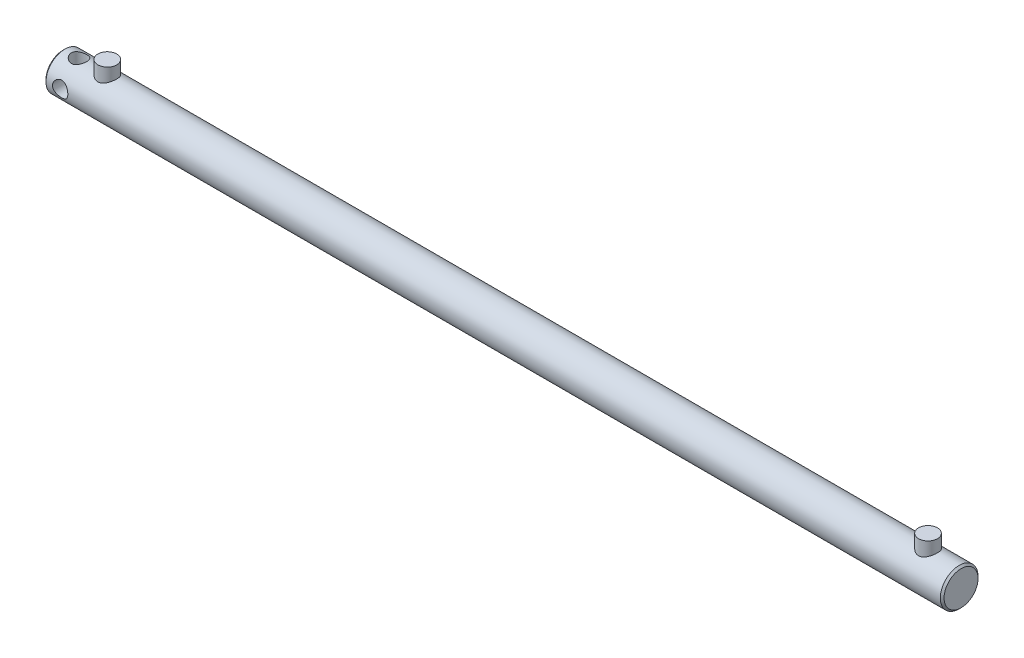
ISO-10303-21;
HEADER;
FILE_DESCRIPTION(('STEP AP214'),'2;1');
FILE_NAME('part.step','',(''),(''),'','','');
FILE_SCHEMA(('AUTOMOTIVE_DESIGN { 1 0 10303 214 1 1 1 1 }'));
ENDSEC;
DATA;
#1=APPLICATION_CONTEXT('core data for automotive mechanical design processes');
#2=APPLICATION_PROTOCOL_DEFINITION('international standard','automotive_design',2000,#1);
#3=PRODUCT_CONTEXT('',#1,'mechanical');
#4=PRODUCT('Part','Part','',(#3));
#5=PRODUCT_RELATED_PRODUCT_CATEGORY('part','',(#4));
#6=PRODUCT_DEFINITION_FORMATION('','',#4);
#7=PRODUCT_DEFINITION_CONTEXT('part definition',#1,'design');
#8=PRODUCT_DEFINITION('design','',#6,#7);
#9=PRODUCT_DEFINITION_SHAPE('','',#8);
#10=(LENGTH_UNIT() NAMED_UNIT(*) SI_UNIT(.MILLI.,.METRE.));
#11=(NAMED_UNIT(*) PLANE_ANGLE_UNIT() SI_UNIT($,.RADIAN.));
#12=(NAMED_UNIT(*) SI_UNIT($,.STERADIAN.) SOLID_ANGLE_UNIT());
#13=UNCERTAINTY_MEASURE_WITH_UNIT(LENGTH_MEASURE(1.E-05),#10,'distance_accuracy_value','');
#14=(GEOMETRIC_REPRESENTATION_CONTEXT(3) GLOBAL_UNCERTAINTY_ASSIGNED_CONTEXT((#13)) GLOBAL_UNIT_ASSIGNED_CONTEXT((#10,
#11,#12)) REPRESENTATION_CONTEXT('',''));
#15=CARTESIAN_POINT('',(0.,0.,0.));
#16=DIRECTION('',(0.,0.,1.));
#17=DIRECTION('',(1.,0.,0.));
#18=AXIS2_PLACEMENT_3D('',#15,#16,#17);
#19=CARTESIAN_POINT('',(-459.,0.,-20.));
#20=DIRECTION('',(0.,0.,1.));
#21=DIRECTION('',(1.,0.,0.));
#22=AXIS2_PLACEMENT_3D('',#19,#20,#21);
#23=CYLINDRICAL_SURFACE('',#22,8.09999999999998);
#24=CARTESIAN_POINT('',(-450.9,0.,20.));
#25=CARTESIAN_POINT('',(-450.900001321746,-0.217553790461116,19.9999989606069));
#26=CARTESIAN_POINT('',(-450.908776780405,-0.435188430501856,19.9964404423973));
#27=CARTESIAN_POINT('',(-450.943798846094,-0.868915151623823,19.9822953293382));
#28=CARTESIAN_POINT('',(-450.970056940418,-1.085006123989,19.9717041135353));
#29=CARTESIAN_POINT('',(-451.039857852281,-1.51445060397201,19.9437418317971));
#30=CARTESIAN_POINT('',(-451.083440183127,-1.72779669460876,19.9263552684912));
#31=CARTESIAN_POINT('',(-451.187452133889,-2.14972461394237,19.8852614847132));
#32=CARTESIAN_POINT('',(-451.247882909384,-2.35830611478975,19.8615538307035));
#33=CARTESIAN_POINT('',(-451.384784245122,-2.76859175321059,19.8085220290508));
#34=CARTESIAN_POINT('',(-451.461199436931,-2.97031690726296,19.7792172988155));
#35=CARTESIAN_POINT('',(-451.629534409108,-3.3663843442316,19.7156711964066));
#36=CARTESIAN_POINT('',(-451.721454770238,-3.56072635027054,19.6814296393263));
#37=CARTESIAN_POINT('',(-451.920016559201,-3.94078379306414,19.6088661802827));
#38=CARTESIAN_POINT('',(-452.026649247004,-4.12650426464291,19.5705467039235));
#39=CARTESIAN_POINT('',(-452.253961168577,-4.48850295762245,19.4907084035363));
#40=CARTESIAN_POINT('',(-452.374645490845,-4.66477772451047,19.4491884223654));
#41=CARTESIAN_POINT('',(-452.63482150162,-5.01438229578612,19.3620718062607));
#42=CARTESIAN_POINT('',(-452.774904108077,-5.18724787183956,19.3163763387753));
#43=CARTESIAN_POINT('',(-453.068619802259,-5.52069726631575,19.2237314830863));
#44=CARTESIAN_POINT('',(-453.222253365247,-5.68128065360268,19.1767820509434));
#45=CARTESIAN_POINT('',(-453.542284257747,-5.98938278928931,19.0827999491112));
#46=CARTESIAN_POINT('',(-453.708689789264,-6.1368930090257,19.0357672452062));
#47=CARTESIAN_POINT('',(-454.053204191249,-6.41783459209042,18.9428953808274));
#48=CARTESIAN_POINT('',(-454.231309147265,-6.55127062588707,18.8970558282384));
#49=CARTESIAN_POINT('',(-454.606840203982,-6.80914100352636,18.8057217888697));
#50=CARTESIAN_POINT('',(-454.804779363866,-6.93287030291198,18.760342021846));
#51=CARTESIAN_POINT('',(-455.21120099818,-7.16306636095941,18.6736608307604));
#52=CARTESIAN_POINT('',(-455.419679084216,-7.26954022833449,18.6323577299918));
#53=CARTESIAN_POINT('',(-455.845884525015,-7.4643447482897,18.555175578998));
#54=CARTESIAN_POINT('',(-456.063610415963,-7.55267825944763,18.5192956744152));
#55=CARTESIAN_POINT('',(-456.506807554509,-7.71033713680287,18.4542132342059));
#56=CARTESIAN_POINT('',(-456.732278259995,-7.77966383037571,18.4250102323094));
#57=CARTESIAN_POINT('',(-457.178677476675,-7.8957894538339,18.3755355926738));
#58=CARTESIAN_POINT('',(-457.399335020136,-7.94348076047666,18.3549138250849));
#59=CARTESIAN_POINT('',(-457.844442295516,-8.02032945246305,18.321464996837));
#60=CARTESIAN_POINT('',(-458.06889191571,-8.04948738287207,18.3086377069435));
#61=CARTESIAN_POINT('',(-458.519666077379,-8.08890880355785,18.2912553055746));
#62=CARTESIAN_POINT('',(-458.745989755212,-8.09918055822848,18.2866965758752));
#63=CARTESIAN_POINT('',(-459.198709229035,-8.10072505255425,18.2860126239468));
#64=CARTESIAN_POINT('',(-459.425105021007,-8.09199871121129,18.2898869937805));
#65=CARTESIAN_POINT('',(-459.859830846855,-8.05697039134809,18.3053422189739));
#66=CARTESIAN_POINT('',(-460.068288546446,-8.03197836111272,18.3163484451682));
#67=CARTESIAN_POINT('',(-460.482250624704,-7.96598244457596,18.3451470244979));
#68=CARTESIAN_POINT('',(-460.687753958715,-7.92497303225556,18.362941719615));
#69=CARTESIAN_POINT('',(-461.094312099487,-7.82735937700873,18.4047618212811));
#70=CARTESIAN_POINT('',(-461.29536798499,-7.77075896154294,18.4287856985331));
#71=CARTESIAN_POINT('',(-461.691918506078,-7.64244879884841,18.4823647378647));
#72=CARTESIAN_POINT('',(-461.887410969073,-7.57073323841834,18.5119220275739));
#73=CARTESIAN_POINT('',(-462.275541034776,-7.41119054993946,18.5763775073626));
#74=CARTESIAN_POINT('',(-462.468040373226,-7.32306621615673,18.6113718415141));
#75=CARTESIAN_POINT('',(-462.845021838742,-7.13235218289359,18.6852885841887));
#76=CARTESIAN_POINT('',(-463.029501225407,-7.02975758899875,18.7242123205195));
#77=CARTESIAN_POINT('',(-463.389462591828,-6.81080050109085,18.8049623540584));
#78=CARTESIAN_POINT('',(-463.564943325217,-6.69443610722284,18.8467890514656));
#79=CARTESIAN_POINT('',(-463.90603190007,-6.44864679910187,18.932297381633));
#80=CARTESIAN_POINT('',(-464.071639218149,-6.3192211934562,18.9759791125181));
#81=CARTESIAN_POINT('',(-464.404955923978,-6.03720358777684,19.0676654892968));
#82=CARTESIAN_POINT('',(-464.571781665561,-5.88358742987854,19.1157372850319));
#83=CARTESIAN_POINT('',(-464.891974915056,-5.56290919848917,19.2115077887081));
#84=CARTESIAN_POINT('',(-465.045346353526,-5.39585107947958,19.2592066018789));
#85=CARTESIAN_POINT('',(-465.337835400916,-5.04909074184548,19.3530089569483));
#86=CARTESIAN_POINT('',(-465.476944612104,-4.86938117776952,19.3991115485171));
#87=CARTESIAN_POINT('',(-465.739815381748,-4.49850306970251,19.4884538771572));
#88=CARTESIAN_POINT('',(-465.86358307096,-4.30733914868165,19.5316947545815));
#89=CARTESIAN_POINT('',(-466.097369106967,-3.91043655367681,19.6150570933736));
#90=CARTESIAN_POINT('',(-466.207039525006,-3.70447453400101,19.6550927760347));
#91=CARTESIAN_POINT('',(-466.408471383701,-3.28314601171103,19.729842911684));
#92=CARTESIAN_POINT('',(-466.500240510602,-3.06778359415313,19.7645596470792));
#93=CARTESIAN_POINT('',(-466.665018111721,-2.62913934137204,19.8276753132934));
#94=CARTESIAN_POINT('',(-466.738030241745,-2.40585905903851,19.8560754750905));
#95=CARTESIAN_POINT('',(-466.864528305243,-1.95305901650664,19.9057131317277));
#96=CARTESIAN_POINT('',(-466.918015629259,-1.72353970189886,19.926951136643));
#97=CARTESIAN_POINT('',(-467.002224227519,-1.27415358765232,19.9605660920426));
#98=CARTESIAN_POINT('',(-467.034125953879,-1.05454166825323,19.9734009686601));
#99=CARTESIAN_POINT('',(-467.079807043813,-0.613140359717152,19.9918193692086));
#100=CARTESIAN_POINT('',(-467.093587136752,-0.391351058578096,19.9974031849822));
#101=CARTESIAN_POINT('',(-467.102871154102,0.0526198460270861,20.0011625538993));
#102=CARTESIAN_POINT('',(-467.098379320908,0.274801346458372,19.9993398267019));
#103=CARTESIAN_POINT('',(-467.071179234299,0.717859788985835,19.9883410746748));
#104=CARTESIAN_POINT('',(-467.048471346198,0.93873675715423,19.9791651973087));
#105=CARTESIAN_POINT('',(-466.986569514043,1.36724903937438,19.954311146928));
#106=CARTESIAN_POINT('',(-466.948192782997,1.57502190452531,19.9389557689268));
#107=CARTESIAN_POINT('',(-466.855464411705,1.98649733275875,19.9021734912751));
#108=CARTESIAN_POINT('',(-466.801107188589,2.19019844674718,19.8807444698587));
#109=CARTESIAN_POINT('',(-466.676934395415,2.59208434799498,19.8323487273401));
#110=CARTESIAN_POINT('',(-466.607123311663,2.79027071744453,19.8053836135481));
#111=CARTESIAN_POINT('',(-466.452592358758,3.18006963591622,19.7465447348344));
#112=CARTESIAN_POINT('',(-466.367866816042,3.37167964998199,19.7146691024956));
#113=CARTESIAN_POINT('',(-466.181383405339,3.75288057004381,19.6457256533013));
#114=CARTESIAN_POINT('',(-466.079186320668,3.94223332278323,19.6085295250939));
#115=CARTESIAN_POINT('',(-465.860392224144,4.3117445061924,19.5306049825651));
#116=CARTESIAN_POINT('',(-465.743790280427,4.4918997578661,19.4898753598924));
#117=CARTESIAN_POINT('',(-465.496967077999,4.84203534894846,19.4058526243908));
#118=CARTESIAN_POINT('',(-465.366743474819,5.01201392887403,19.3625590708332));
#119=CARTESIAN_POINT('',(-465.093473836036,5.34090761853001,19.2744311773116));
#120=CARTESIAN_POINT('',(-464.950427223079,5.49982222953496,19.2295967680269));
#121=CARTESIAN_POINT('',(-464.642171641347,5.81617801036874,19.1363810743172));
#122=CARTESIAN_POINT('',(-464.476117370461,5.97278662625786,19.0879656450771));
#123=CARTESIAN_POINT('',(-464.131317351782,6.27149075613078,18.9919197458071));
#124=CARTESIAN_POINT('',(-463.952575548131,6.41359074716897,18.9442890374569));
#125=CARTESIAN_POINT('',(-463.583258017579,6.68251089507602,18.8511091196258));
#126=CARTESIAN_POINT('',(-463.392675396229,6.80932202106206,18.8055611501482));
#127=CARTESIAN_POINT('',(-463.000949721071,7.04661740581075,18.7179373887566));
#128=CARTESIAN_POINT('',(-462.79981115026,7.15710852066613,18.6758601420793));
#129=CARTESIAN_POINT('',(-462.385735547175,7.3621175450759,18.5960069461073));
#130=CARTESIAN_POINT('',(-462.17268924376,7.45643666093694,18.5582861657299));
#131=CARTESIAN_POINT('',(-461.738475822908,7.62660439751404,18.4890062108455));
#132=CARTESIAN_POINT('',(-461.517312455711,7.70246142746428,18.4574442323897));
#133=CARTESIAN_POINT('',(-461.068484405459,7.834927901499,18.4016053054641));
#134=CARTESIAN_POINT('',(-460.840822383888,7.89154510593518,18.3773254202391));
#135=CARTESIAN_POINT('',(-460.380747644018,7.98489928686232,18.3369567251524));
#136=CARTESIAN_POINT('',(-460.148335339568,8.02163798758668,18.3208672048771));
#137=CARTESIAN_POINT('',(-459.697962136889,8.07281706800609,18.2983698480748));
#138=CARTESIAN_POINT('',(-459.480195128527,8.08869834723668,18.2913371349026));
#139=CARTESIAN_POINT('',(-459.043982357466,8.10281912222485,18.2850864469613));
#140=CARTESIAN_POINT('',(-458.825536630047,8.10105952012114,18.2858680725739));
#141=CARTESIAN_POINT('',(-458.389698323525,8.07992140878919,18.2952179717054));
#142=CARTESIAN_POINT('',(-458.172305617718,8.06054507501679,18.3037852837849));
#143=CARTESIAN_POINT('',(-457.740212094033,8.00439867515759,18.3284079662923));
#144=CARTESIAN_POINT('',(-457.525511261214,7.96762870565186,18.3444632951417));
#145=CARTESIAN_POINT('',(-457.109281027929,7.8789942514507,18.3827003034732));
#146=CARTESIAN_POINT('',(-456.907576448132,7.8278259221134,18.4045974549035));
#147=CARTESIAN_POINT('',(-456.509277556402,7.7103455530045,18.4541223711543));
#148=CARTESIAN_POINT('',(-456.312685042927,7.64402826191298,18.4817521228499));
#149=CARTESIAN_POINT('',(-455.925853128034,7.49682896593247,18.5419489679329));
#150=CARTESIAN_POINT('',(-455.735612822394,7.4159490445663,18.5745153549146));
#151=CARTESIAN_POINT('',(-455.362404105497,7.24019743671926,18.6437243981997));
#152=CARTESIAN_POINT('',(-455.179438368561,7.14532066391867,18.6803685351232));
#153=CARTESIAN_POINT('',(-454.811381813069,6.93634048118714,18.7590072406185));
#154=CARTESIAN_POINT('',(-454.626782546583,6.82144138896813,18.8011888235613));
#155=CARTESIAN_POINT('',(-454.26777997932,6.57747679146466,18.8879208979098));
#156=CARTESIAN_POINT('',(-454.093377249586,6.44841049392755,18.9324715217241));
#157=CARTESIAN_POINT('',(-453.755596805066,6.17682899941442,19.0228091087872));
#158=CARTESIAN_POINT('',(-453.592223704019,6.03430823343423,19.0685965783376));
#159=CARTESIAN_POINT('',(-453.277481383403,5.73669576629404,19.1602337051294));
#160=CARTESIAN_POINT('',(-453.126108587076,5.58160783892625,19.2060833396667));
#161=CARTESIAN_POINT('',(-452.826319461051,5.24873029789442,19.2998110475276));
#162=CARTESIAN_POINT('',(-452.678795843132,5.07011468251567,19.3476165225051));
#163=CARTESIAN_POINT('',(-452.399354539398,4.70054560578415,19.4407090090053));
#164=CARTESIAN_POINT('',(-452.267431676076,4.50959627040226,19.4859968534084));
#165=CARTESIAN_POINT('',(-452.020029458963,4.11631109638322,19.5728526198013));
#166=CARTESIAN_POINT('',(-451.904562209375,3.91396702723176,19.6144177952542));
#167=CARTESIAN_POINT('',(-451.691166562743,3.49932983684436,19.6926175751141));
#168=CARTESIAN_POINT('',(-451.593236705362,3.28703754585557,19.7292525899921));
#169=CARTESIAN_POINT('',(-451.417418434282,2.85784311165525,19.7959350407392));
#170=CARTESIAN_POINT('',(-451.339201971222,2.64109201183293,19.8260888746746));
#171=CARTESIAN_POINT('',(-451.20135230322,2.20096724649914,19.8797603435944));
#172=CARTESIAN_POINT('',(-451.141717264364,1.9775942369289,19.9032786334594));
#173=CARTESIAN_POINT('',(-451.041807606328,1.526562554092,19.9429368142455));
#174=CARTESIAN_POINT('',(-451.001481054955,1.29891710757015,19.959096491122));
#175=CARTESIAN_POINT('',(-450.94043734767,0.84071264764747,19.9836373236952));
#176=CARTESIAN_POINT('',(-450.919705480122,0.610155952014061,19.9920243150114));
#177=CARTESIAN_POINT('',(-450.905919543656,0.31601419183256,19.9976033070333));
#178=CARTESIAN_POINT('',(-450.903700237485,0.252837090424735,19.998501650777));
#179=CARTESIAN_POINT('',(-450.900740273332,0.12644226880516,19.9997001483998));
#180=CARTESIAN_POINT('',(-450.89999961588,0.0632245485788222,20.0000003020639));
#181=CARTESIAN_POINT('',(-450.9,0.,20.));
#182=B_SPLINE_CURVE_WITH_KNOTS('',3,(#24,#25,#26,#27,#28,#29,#30,#31,#32,#33,#34,#35,#36,#37,
#38,#39,#40,#41,#42,#43,#44,#45,#46,#47,#48,#49,#50,#51,#52,#53,#54,#55,#56,#57,#58,#59,#60,#61,
#62,#63,#64,#65,#66,#67,#68,#69,#70,#71,#72,#73,#74,#75,#76,#77,#78,#79,#80,#81,#82,#83,#84,#85,
#86,#87,#88,#89,#90,#91,#92,#93,#94,#95,#96,#97,#98,#99,#100,#101,#102,#103,#104,#105,#106,#107,
#108,#109,#110,#111,#112,#113,#114,#115,#116,#117,#118,#119,#120,#121,#122,#123,#124,#125,#126,
#127,#128,#129,#130,#131,#132,#133,#134,#135,#136,#137,#138,#139,#140,#141,#142,#143,#144,#145,
#146,#147,#148,#149,#150,#151,#152,#153,#154,#155,#156,#157,#158,#159,#160,#161,#162,#163,#164,
#165,#166,#167,#168,#169,#170,#171,#172,#173,#174,#175,#176,#177,#178,#179,#180,#181),
.UNSPECIFIED.,.T.,.F.,(4,2,2,2,2,2,2,2,2,2,2,2,2,2,2,2,2,2,2,2,2,2,2,2,2,2,2,2,2,2,2,2,2,2,2,2,
2,2,2,2,2,2,2,2,2,2,2,2,2,2,2,2,2,2,2,2,2,2,2,2,2,2,2,2,2,2,2,2,2,2,2,2,2,2,2,2,2,2,4),(0.,
0.652596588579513,1.30562240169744,1.96014626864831,2.61471503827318,3.2670529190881,
3.91941523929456,4.57139167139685,5.22360494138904,5.90428093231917,6.58498080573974,
7.26612153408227,7.9470355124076,8.65954656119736,9.37176332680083,10.0838677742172,
10.7959224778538,11.4750993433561,12.1542562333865,12.8331158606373,13.5119426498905,
14.1419204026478,14.7721156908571,15.4021564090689,16.0324398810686,16.6755035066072,
17.3187851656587,17.9621556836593,18.6055602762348,19.3002237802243,19.9946836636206,
20.6895501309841,21.3841380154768,22.093481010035,22.8025187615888,23.5114182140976,
24.2202671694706,24.8862793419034,25.5522647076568,26.2180954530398,26.8839128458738,
27.5187156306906,28.1537404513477,28.7885811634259,29.4236638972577,30.0780389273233,
30.7326386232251,31.3873511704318,32.042093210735,32.7412878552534,33.440266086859,
34.1396551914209,34.8387496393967,35.5459021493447,36.252731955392,36.9592763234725,
37.6657593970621,38.3202973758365,38.9748018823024,39.6292255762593,40.283645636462,
40.9106764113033,41.5379248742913,42.1650836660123,42.7924709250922,43.4562239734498,
44.1200141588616,44.7840803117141,45.4479477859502,46.1567243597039,46.8652650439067,
47.5743242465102,48.2833243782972,48.9796040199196,49.6758149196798,50.3701426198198,
51.063948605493,51.2536033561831,51.4432581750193),.UNSPECIFIED.);
#183=CARTESIAN_POINT('',(-450.9,0.,20.));
#184=VERTEX_POINT('',#183);
#185=EDGE_CURVE('E123',#184,#184,#182,.T.);
#186=ORIENTED_EDGE('',*,*,#185,.F.);
#187=EDGE_LOOP('',(#186));
#188=FACE_BOUND('',#187,.T.);
#189=CARTESIAN_POINT('',(-459.,0.,0.));
#190=DIRECTION('',(0.,-0.707106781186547,0.707106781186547));
#191=DIRECTION('',(0.,-0.707106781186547,-0.707106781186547));
#192=AXIS2_PLACEMENT_3D('',#189,#190,#191);
#193=ELLIPSE('',#192,11.455129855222,8.09999999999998);
#194=CARTESIAN_POINT('',(-467.1,0.,0.));
#195=VERTEX_POINT('',#194);
#196=CARTESIAN_POINT('',(-450.9,0.,0.));
#197=VERTEX_POINT('',#196);
#198=EDGE_CURVE('E62',#195,#197,#193,.F.);
#199=ORIENTED_EDGE('',*,*,#198,.T.);
#200=CARTESIAN_POINT('',(-459.,0.,0.));
#201=DIRECTION('',(0.,0.707106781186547,0.707106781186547));
#202=DIRECTION('',(0.,0.707106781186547,-0.707106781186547));
#203=AXIS2_PLACEMENT_3D('',#200,#201,#202);
#204=ELLIPSE('',#203,11.455129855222,8.09999999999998);
#205=EDGE_CURVE('E50',#195,#197,#204,.T.);
#206=ORIENTED_EDGE('',*,*,#205,.F.);
#207=EDGE_LOOP('',(#199,#206));
#208=FACE_BOUND('',#207,.T.);
#209=ADVANCED_FACE('F32',(#188,#208),#23,.F.);
#210=CARTESIAN_POINT('',(-476.,0.,0.));
#211=DIRECTION('',(-1.,0.,0.));
#212=DIRECTION('',(0.,0.,1.));
#213=AXIS2_PLACEMENT_3D('',#210,#211,#212);
#214=CYLINDRICAL_SURFACE('',#213,20.);
#215=CARTESIAN_POINT('',(-459.,-18.2863336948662,8.09999999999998));
#216=CARTESIAN_POINT('',(-459.216727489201,-18.2863350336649,8.09999866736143));
#217=CARTESIAN_POINT('',(-459.433539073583,-18.2901999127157,8.09128900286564));
#218=CARTESIAN_POINT('',(-459.865595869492,-18.3055341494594,8.0565358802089));
#219=CARTESIAN_POINT('',(-460.080839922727,-18.3170086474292,8.03048070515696));
#220=CARTESIAN_POINT('',(-460.508531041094,-18.3472088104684,7.96124084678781));
#221=CARTESIAN_POINT('',(-460.720970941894,-18.3659503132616,7.91801874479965));
#222=CARTESIAN_POINT('',(-461.141133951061,-18.4100725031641,7.81488136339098));
#223=CARTESIAN_POINT('',(-461.348855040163,-18.4354559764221,7.75495907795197));
#224=CARTESIAN_POINT('',(-461.757241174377,-18.4919351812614,7.61929805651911));
#225=CARTESIAN_POINT('',(-461.957933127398,-18.5230054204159,7.54362970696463));
#226=CARTESIAN_POINT('',(-462.35204285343,-18.5900084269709,7.37696690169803));
#227=CARTESIAN_POINT('',(-462.545457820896,-18.6259430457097,7.28596660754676));
#228=CARTESIAN_POINT('',(-463.112824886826,-18.7394864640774,6.99114168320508));
#229=CARTESIAN_POINT('',(-463.474432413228,-18.8229128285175,6.76531436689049));
#230=CARTESIAN_POINT('',(-464.174967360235,-19.001293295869,6.24735624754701));
#231=CARTESIAN_POINT('',(-464.511662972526,-19.096624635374,5.95233600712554));
#232=CARTESIAN_POINT('',(-464.977027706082,-19.2378011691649,5.47129733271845));
#233=CARTESIAN_POINT('',(-465.125625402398,-19.2845884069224,5.30440395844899));
#234=CARTESIAN_POINT('',(-465.408725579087,-19.3763732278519,4.9586387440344));
#235=CARTESIAN_POINT('',(-465.543233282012,-19.4213714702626,4.77977138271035));
#236=CARTESIAN_POINT('',(-465.80250145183,-19.5102173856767,4.40344429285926));
#237=CARTESIAN_POINT('',(-465.926633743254,-19.5539416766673,4.20552249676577));
#238=CARTESIAN_POINT('',(-466.157635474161,-19.6369582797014,3.79906122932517));
#239=CARTESIAN_POINT('',(-466.264511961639,-19.6762523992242,3.59052613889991));
#240=CARTESIAN_POINT('',(-466.460089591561,-19.7492963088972,3.16418400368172));
#241=CARTESIAN_POINT('',(-466.548792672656,-19.7830466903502,2.94637795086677));
#242=CARTESIAN_POINT('',(-466.70714487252,-19.8440101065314,2.50305959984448));
#243=CARTESIAN_POINT('',(-466.776795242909,-19.8712235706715,2.2775478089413));
#244=CARTESIAN_POINT('',(-466.893323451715,-19.9171241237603,1.83189452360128));
#245=CARTESIAN_POINT('',(-466.941157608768,-19.9361664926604,1.61203948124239));
#246=CARTESIAN_POINT('',(-467.018414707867,-19.9670658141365,1.16861718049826));
#247=CARTESIAN_POINT('',(-467.047838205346,-19.978922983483,0.945050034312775));
#248=CARTESIAN_POINT('',(-467.087937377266,-19.9951092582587,0.496042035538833));
#249=CARTESIAN_POINT('',(-467.098619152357,-19.9994408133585,0.270601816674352));
#250=CARTESIAN_POINT('',(-467.101129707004,-20.0004574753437,-0.180397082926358));
#251=CARTESIAN_POINT('',(-467.092959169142,-19.9971428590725,-0.405955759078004));
#252=CARTESIAN_POINT('',(-467.058879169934,-19.9833758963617,-0.842357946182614));
#253=CARTESIAN_POINT('',(-467.034022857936,-19.9733474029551,-1.05329810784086));
#254=CARTESIAN_POINT('',(-466.967901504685,-19.9468427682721,-1.47225464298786));
#255=CARTESIAN_POINT('',(-466.926630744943,-19.9303643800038,-1.68026997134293));
#256=CARTESIAN_POINT('',(-466.828094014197,-19.8913803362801,-2.09181801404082));
#257=CARTESIAN_POINT('',(-466.77083344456,-19.8688767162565,-2.29535221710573));
#258=CARTESIAN_POINT('',(-466.640804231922,-19.8183829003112,-2.69678401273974));
#259=CARTESIAN_POINT('',(-466.568029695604,-19.790390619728,-2.89467943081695));
#260=CARTESIAN_POINT('',(-466.406409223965,-19.7291465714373,-3.28643605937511));
#261=CARTESIAN_POINT('',(-466.317342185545,-19.6958233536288,-3.48019479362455));
#262=CARTESIAN_POINT('',(-466.124543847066,-19.6250117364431,-3.85955505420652));
#263=CARTESIAN_POINT('',(-466.020807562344,-19.5875219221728,-4.04515377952));
#264=CARTESIAN_POINT('',(-465.799416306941,-19.5092629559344,-4.4071484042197));
#265=CARTESIAN_POINT('',(-465.68175993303,-19.4684934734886,-4.58354337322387));
#266=CARTESIAN_POINT('',(-465.433284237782,-19.3846194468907,-4.92622089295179));
#267=CARTESIAN_POINT('',(-465.302464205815,-19.3415147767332,-5.09250289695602));
#268=CARTESIAN_POINT('',(-465.019189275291,-19.2510112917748,-5.42496150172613));
#269=CARTESIAN_POINT('',(-464.865870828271,-19.2035187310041,-5.59037762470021));
#270=CARTESIAN_POINT('',(-464.546078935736,-19.1082627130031,-5.90777016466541));
#271=CARTESIAN_POINT('',(-464.379609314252,-19.060499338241,-6.05975046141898));
#272=CARTESIAN_POINT('',(-464.034296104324,-18.9659312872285,-6.34954339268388));
#273=CARTESIAN_POINT('',(-463.855443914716,-18.9191273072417,-6.48734601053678));
#274=CARTESIAN_POINT('',(-463.486535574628,-18.8278272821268,-6.74773688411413));
#275=CARTESIAN_POINT('',(-463.296483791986,-18.7833303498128,-6.8703310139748));
#276=CARTESIAN_POINT('',(-462.900295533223,-18.6966264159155,-7.10295975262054));
#277=CARTESIAN_POINT('',(-462.693846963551,-18.6545287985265,-7.21250467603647));
#278=CARTESIAN_POINT('',(-462.271523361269,-18.5755179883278,-7.41362318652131));
#279=CARTESIAN_POINT('',(-462.055652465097,-18.5386025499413,-7.50520456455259));
#280=CARTESIAN_POINT('',(-461.615951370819,-18.471221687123,-7.66954123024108));
#281=CARTESIAN_POINT('',(-461.392123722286,-18.4407542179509,-7.74230248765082));
#282=CARTESIAN_POINT('',(-460.938144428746,-18.3873766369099,-7.86823170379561));
#283=CARTESIAN_POINT('',(-460.707993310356,-18.3644658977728,-7.92140128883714));
#284=CARTESIAN_POINT('',(-460.25773486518,-18.3282491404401,-8.00482463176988));
#285=CARTESIAN_POINT('',(-460.037894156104,-18.3144340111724,-8.03629885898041));
#286=CARTESIAN_POINT('',(-459.596018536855,-18.2947133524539,-8.0810932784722));
#287=CARTESIAN_POINT('',(-459.373983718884,-18.2888074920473,-8.09441423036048));
#288=CARTESIAN_POINT('',(-458.929565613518,-18.2851195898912,-8.10274162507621));
#289=CARTESIAN_POINT('',(-458.707182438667,-18.2873353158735,-8.09775310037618));
#290=CARTESIAN_POINT('',(-458.263808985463,-18.299805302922,-8.06953304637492));
#291=CARTESIAN_POINT('',(-458.042818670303,-18.3100593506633,-8.04630200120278));
#292=CARTESIAN_POINT('',(-457.617003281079,-18.3373998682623,-7.98378654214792));
#293=CARTESIAN_POINT('',(-457.411996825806,-18.3540450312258,-7.94553598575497));
#294=CARTESIAN_POINT('',(-457.006050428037,-18.39361319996,-7.8535024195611));
#295=CARTESIAN_POINT('',(-456.80511191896,-18.4165383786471,-7.7997140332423));
#296=CARTESIAN_POINT('',(-456.408654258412,-18.4679845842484,-7.67710624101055));
#297=CARTESIAN_POINT('',(-456.21313398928,-18.4965044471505,-7.60828996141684));
#298=CARTESIAN_POINT('',(-455.828554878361,-18.5583396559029,-7.45618907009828));
#299=CARTESIAN_POINT('',(-455.639498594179,-18.5916568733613,-7.37289880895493));
#300=CARTESIAN_POINT('',(-455.068514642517,-18.7003629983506,-7.0948696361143));
#301=CARTESIAN_POINT('',(-454.698842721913,-18.7823223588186,-6.87692915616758));
#302=CARTESIAN_POINT('',(-453.99966634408,-18.9546321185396,-6.38663999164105));
#303=CARTESIAN_POINT('',(-453.670178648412,-19.0449859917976,-6.11426872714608));
#304=CARTESIAN_POINT('',(-453.199495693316,-19.1836148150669,-5.65834188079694));
#305=CARTESIAN_POINT('',(-453.041566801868,-19.2320695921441,-5.49179167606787));
#306=CARTESIAN_POINT('',(-452.740243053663,-19.3275487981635,-5.14568122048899));
#307=CARTESIAN_POINT('',(-452.596843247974,-19.3745737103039,-4.96612543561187));
#308=CARTESIAN_POINT('',(-452.325466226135,-19.4659462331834,-4.59494200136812));
#309=CARTESIAN_POINT('',(-452.197496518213,-19.5102925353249,-4.40330854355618));
#310=CARTESIAN_POINT('',(-451.95806431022,-19.5950587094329,-4.00927156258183));
#311=CARTESIAN_POINT('',(-451.846594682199,-19.6354802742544,-3.80687274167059));
#312=CARTESIAN_POINT('',(-451.640954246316,-19.7113269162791,-3.39234693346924));
#313=CARTESIAN_POINT('',(-451.546797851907,-19.7467478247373,-3.1802120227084));
#314=CARTESIAN_POINT('',(-451.376784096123,-19.8115431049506,-2.74782464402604));
#315=CARTESIAN_POINT('',(-451.300926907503,-19.8409174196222,-2.52757209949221));
#316=CARTESIAN_POINT('',(-451.168333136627,-19.8927444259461,-2.08069400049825));
#317=CARTESIAN_POINT('',(-451.111587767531,-19.9152002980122,-1.85407142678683));
#318=CARTESIAN_POINT('',(-451.017813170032,-19.9525299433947,-1.39617247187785));
#319=CARTESIAN_POINT('',(-450.980782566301,-19.9674042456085,-1.16489641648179));
#320=CARTESIAN_POINT('',(-450.928672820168,-19.988391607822,-0.715161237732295));
#321=CARTESIAN_POINT('',(-450.912294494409,-19.9950227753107,-0.496875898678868));
#322=CARTESIAN_POINT('',(-450.897265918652,-20.0011062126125,-0.0596004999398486));
#323=CARTESIAN_POINT('',(-450.898614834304,-20.0005588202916,0.159389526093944));
#324=CARTESIAN_POINT('',(-450.919023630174,-19.9923008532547,0.596371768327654));
#325=CARTESIAN_POINT('',(-450.93808094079,-19.9845913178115,0.814364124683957));
#326=CARTESIAN_POINT('',(-450.993698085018,-19.9622198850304,1.24774031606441));
#327=CARTESIAN_POINT('',(-451.030257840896,-19.9475580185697,1.46312416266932));
#328=CARTESIAN_POINT('',(-451.119037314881,-19.9122568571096,1.88279953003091));
#329=CARTESIAN_POINT('',(-451.170711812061,-19.8918264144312,2.08722442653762));
#330=CARTESIAN_POINT('',(-451.289638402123,-19.8453188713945,2.49090669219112));
#331=CARTESIAN_POINT('',(-451.356895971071,-19.8192397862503,2.69016221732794));
#332=CARTESIAN_POINT('',(-451.506387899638,-19.7620711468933,3.08217048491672));
#333=CARTESIAN_POINT('',(-451.58861885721,-19.7309827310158,3.27492469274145));
#334=CARTESIAN_POINT('',(-451.767457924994,-19.6645054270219,3.65295469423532));
#335=CARTESIAN_POINT('',(-451.8640715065,-19.629114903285,3.83822760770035));
#336=CARTESIAN_POINT('',(-452.075545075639,-19.5532071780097,4.20824385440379));
#337=CARTESIAN_POINT('',(-452.191022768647,-19.5125325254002,4.39260188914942));
#338=CARTESIAN_POINT('',(-452.436120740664,-19.4283623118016,4.75106856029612));
#339=CARTESIAN_POINT('',(-452.565745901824,-19.3848657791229,4.92517362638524));
#340=CARTESIAN_POINT('',(-452.838310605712,-19.2961087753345,5.26218165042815));
#341=CARTESIAN_POINT('',(-452.981251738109,-19.2508480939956,5.42508326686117));
#342=CARTESIAN_POINT('',(-453.279619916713,-19.1596600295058,5.738825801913));
#343=CARTESIAN_POINT('',(-453.435047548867,-19.1137326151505,5.88966615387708));
#344=CARTESIAN_POINT('',(-453.767866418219,-19.0194152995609,6.1877145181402));
#345=CARTESIAN_POINT('',(-453.946026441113,-18.9710555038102,6.33407500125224));
#346=CARTESIAN_POINT('',(-454.314437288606,-18.8762504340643,6.61124976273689));
#347=CARTESIAN_POINT('',(-454.504684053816,-18.8298045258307,6.7420692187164));
#348=CARTESIAN_POINT('',(-454.896414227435,-18.7401450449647,6.98742054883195));
#349=CARTESIAN_POINT('',(-455.097908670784,-18.696934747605,7.10193602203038));
#350=CARTESIAN_POINT('',(-455.51064014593,-18.6151752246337,7.31355735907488));
#351=CARTESIAN_POINT('',(-455.7218726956,-18.5766238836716,7.41067113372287));
#352=CARTESIAN_POINT('',(-456.151079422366,-18.5057265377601,7.58597141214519));
#353=CARTESIAN_POINT('',(-456.368987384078,-18.4733340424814,7.66430098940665));
#354=CARTESIAN_POINT('',(-456.811467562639,-18.4155262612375,7.8021784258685));
#355=CARTESIAN_POINT('',(-457.036036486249,-18.3901075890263,7.86173540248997));
#356=CARTESIAN_POINT('',(-457.489572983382,-18.3472220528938,7.96130510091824));
#357=CARTESIAN_POINT('',(-457.718527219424,-18.329734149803,8.00136955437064));
#358=CARTESIAN_POINT('',(-458.17940023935,-18.3032934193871,8.06167159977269));
#359=CARTESIAN_POINT('',(-458.411316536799,-18.2943338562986,8.08192483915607));
#360=CARTESIAN_POINT('',(-458.703003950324,-18.2886486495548,8.0947717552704));
#361=CARTESIAN_POINT('',(-458.762380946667,-18.2877810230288,8.09673186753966));
#362=CARTESIAN_POINT('',(-458.881169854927,-18.2866233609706,8.0993461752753));
#363=CARTESIAN_POINT('',(-458.940581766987,-18.2863333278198,8.10000036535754));
#364=CARTESIAN_POINT('',(-459.,-18.2863336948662,8.09999999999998));
#365=B_SPLINE_CURVE_WITH_KNOTS('',3,(#215,#216,#217,#218,#219,#220,#221,#222,#223,#224,#225,
#226,#227,#228,#229,#230,#231,#232,#233,#234,#235,#236,#237,#238,#239,#240,#241,#242,#243,#244,
#245,#246,#247,#248,#249,#250,#251,#252,#253,#254,#255,#256,#257,#258,#259,#260,#261,#262,#263,
#264,#265,#266,#267,#268,#269,#270,#271,#272,#273,#274,#275,#276,#277,#278,#279,#280,#281,#282,
#283,#284,#285,#286,#287,#288,#289,#290,#291,#292,#293,#294,#295,#296,#297,#298,#299,#300,#301,
#302,#303,#304,#305,#306,#307,#308,#309,#310,#311,#312,#313,#314,#315,#316,#317,#318,#319,#320,
#321,#322,#323,#324,#325,#326,#327,#328,#329,#330,#331,#332,#333,#334,#335,#336,#337,#338,#339,
#340,#341,#342,#343,#344,#345,#346,#347,#348,#349,#350,#351,#352,#353,#354,#355,#356,#357,#358,
#359,#360,#361,#362,#363,#364),.UNSPECIFIED.,.T.,.F.,(4,2,2,2,2,2,2,2,2,2,2,2,2,2,2,2,2,2,2,2,2,
2,2,2,2,2,2,2,2,2,2,2,2,2,2,2,2,2,2,2,2,2,2,2,2,2,2,2,2,2,2,2,2,2,2,2,2,2,2,2,2,2,2,2,2,2,2,2,2,
2,2,2,2,2,4),(0.,0.650120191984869,1.30067998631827,1.9526656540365,2.60492525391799,
3.25432952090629,3.90398164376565,5.201602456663,6.56829468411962,7.25259033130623,
7.93663143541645,8.64879821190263,9.36067336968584,10.0724725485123,10.7842249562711,
11.4607573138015,12.1372692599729,12.8135609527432,13.4898281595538,14.1269874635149,
14.7643689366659,15.4015353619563,16.0389442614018,16.6857495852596,17.3327752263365,
17.9798661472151,18.6269920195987,19.3176765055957,20.0081608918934,20.6991298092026,
21.3898310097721,22.1013421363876,22.8125439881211,23.5235199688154,24.2344369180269,
24.9010995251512,25.5677342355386,26.234185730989,26.9006195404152,27.5275267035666,
28.1546510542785,28.7816450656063,29.408884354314,30.713663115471,32.018984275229,
32.722031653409,33.4248387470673,34.1279864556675,34.8308295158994,35.5342550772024,
36.2376872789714,36.9407956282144,37.6438549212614,38.3000298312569,38.9561738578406,
39.6122226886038,40.2682686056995,40.9030783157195,41.5381114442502,42.1730004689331,
42.8081316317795,43.4713331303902,44.1347642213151,44.7982746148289,45.4618161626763,
46.167743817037,46.8734356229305,47.579832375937,48.2859071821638,48.9864198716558,
49.6865918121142,50.3848952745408,51.0826467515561,51.260883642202,51.4391212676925),.UNSPECIFIED.);
#366=CARTESIAN_POINT('',(-459.,-18.2863336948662,8.09999999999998));
#367=VERTEX_POINT('',#366);
#368=EDGE_CURVE('E63',#367,#367,#365,.T.);
#369=ORIENTED_EDGE('',*,*,#368,.F.);
#370=EDGE_LOOP('',(#369));
#371=FACE_BOUND('',#370,.T.);
#372=CARTESIAN_POINT('',(441.,17.3205080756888,-9.99999999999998));
#373=CARTESIAN_POINT('',(440.739336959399,17.3205095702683,-9.99999887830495));
#374=CARTESIAN_POINT('',(440.478651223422,17.3264124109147,-9.98979463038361));
#375=CARTESIAN_POINT('',(439.959288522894,17.3498046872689,-9.94911125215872));
#376=CARTESIAN_POINT('',(439.700612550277,17.3672995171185,-9.91862268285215));
#377=CARTESIAN_POINT('',(439.186976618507,17.4132568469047,-9.83771551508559));
#378=CARTESIAN_POINT('',(438.93202314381,17.4417365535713,-9.78726564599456));
#379=CARTESIAN_POINT('',(438.427950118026,17.5086546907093,-9.66704369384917));
#380=CARTESIAN_POINT('',(438.178833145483,17.5470974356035,-9.59726323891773));
#381=CARTESIAN_POINT('',(437.689526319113,17.6323996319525,-9.439621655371));
#382=CARTESIAN_POINT('',(437.449293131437,17.6792090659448,-9.35186754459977));
#383=CARTESIAN_POINT('',(436.977445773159,17.779982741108,-9.15882440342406));
#384=CARTESIAN_POINT('',(436.745834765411,17.8339495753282,-9.05352901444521));
#385=CARTESIAN_POINT('',(436.292454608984,17.9475017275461,-8.826284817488));
#386=CARTESIAN_POINT('',(436.070683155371,18.0070857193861,-8.70433993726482));
#387=CARTESIAN_POINT('',(435.637840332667,18.1303531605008,-8.44458163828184));
#388=CARTESIAN_POINT('',(435.426769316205,18.1940367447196,-8.30676769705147));
#389=CARTESIAN_POINT('',(434.999162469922,18.329363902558,-8.00400718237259));
#390=CARTESIAN_POINT('',(434.783617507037,18.4012302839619,-7.83775940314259));
#391=CARTESIAN_POINT('',(434.367065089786,18.5460965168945,-7.48852658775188));
#392=CARTESIAN_POINT('',(434.166053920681,18.6190960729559,-7.30554585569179));
#393=CARTESIAN_POINT('',(433.779305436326,18.7644955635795,-6.92354675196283));
#394=CARTESIAN_POINT('',(433.593580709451,18.836894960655,-6.7245154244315));
#395=CARTESIAN_POINT('',(433.238653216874,18.9792540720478,-6.31154503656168));
#396=CARTESIAN_POINT('',(433.069444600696,19.0492146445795,-6.09761130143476));
#397=CARTESIAN_POINT('',(432.737635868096,19.1896470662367,-5.64077435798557));
#398=CARTESIAN_POINT('',(432.576260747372,19.2598322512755,-5.39689043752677));
#399=CARTESIAN_POINT('',(432.274793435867,19.3935808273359,-4.89454568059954));
#400=CARTESIAN_POINT('',(432.134702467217,19.4571438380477,-4.63608400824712));
#401=CARTESIAN_POINT('',(431.877251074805,19.5757886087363,-4.10635184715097));
#402=CARTESIAN_POINT('',(431.759879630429,19.6308744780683,-3.8350876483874));
#403=CARTESIAN_POINT('',(431.549137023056,19.7309453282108,-3.2815928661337));
#404=CARTESIAN_POINT('',(431.455763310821,19.775931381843,-2.99936345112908));
#405=CARTESIAN_POINT('',(431.299971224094,19.8516061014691,-2.44661617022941));
#406=CARTESIAN_POINT('',(431.235823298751,19.8830841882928,-2.17669338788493));
#407=CARTESIAN_POINT('',(431.130069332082,19.9352303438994,-1.63143316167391));
#408=CARTESIAN_POINT('',(431.088462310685,19.9558988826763,-1.3560959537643));
#409=CARTESIAN_POINT('',(431.028360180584,19.9858180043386,-0.802434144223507));
#410=CARTESIAN_POINT('',(431.009853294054,19.9950744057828,-0.524111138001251));
#411=CARTESIAN_POINT('',(430.996171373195,20.001913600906,0.0332441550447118));
#412=CARTESIAN_POINT('',(431.000994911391,19.9994971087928,0.312276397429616));
#413=CARTESIAN_POINT('',(431.032463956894,19.9837839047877,0.844365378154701));
#414=CARTESIAN_POINT('',(431.057172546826,19.9714530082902,1.09756809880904));
#415=CARTESIAN_POINT('',(431.125682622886,19.9374335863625,1.60072224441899));
#416=CARTESIAN_POINT('',(431.169482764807,19.9157457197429,1.8506738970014));
#417=CARTESIAN_POINT('',(431.275699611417,19.8635314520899,2.34564683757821));
#418=CARTESIAN_POINT('',(431.33811692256,19.8330047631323,2.59066796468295));
#419=CARTESIAN_POINT('',(431.480930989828,19.7638249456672,3.07423071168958));
#420=CARTESIAN_POINT('',(431.561328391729,19.7251715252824,3.31277209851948));
#421=CARTESIAN_POINT('',(431.740572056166,19.6400278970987,3.78519130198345));
#422=CARTESIAN_POINT('',(431.839654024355,19.5934383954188,4.01896179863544));
#423=CARTESIAN_POINT('',(432.054690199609,19.4938328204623,4.47722728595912));
#424=CARTESIAN_POINT('',(432.170650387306,19.4408144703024,4.70171895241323));
#425=CARTESIAN_POINT('',(432.542514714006,19.2738101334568,5.35951935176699));
#426=CARTESIAN_POINT('',(432.82251161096,19.1518214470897,5.77743819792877));
#427=CARTESIAN_POINT('',(433.469040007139,18.8844067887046,6.60185513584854));
#428=CARTESIAN_POINT('',(433.841249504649,18.7378553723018,7.00353936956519));
#429=CARTESIAN_POINT('',(434.44463841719,18.5185765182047,7.55658054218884));
#430=CARTESIAN_POINT('',(434.653451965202,18.4455210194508,7.73279224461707));
#431=CARTESIAN_POINT('',(435.085322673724,18.301419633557,8.06791510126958));
#432=CARTESIAN_POINT('',(435.308381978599,18.2303740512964,8.22682364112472));
#433=CARTESIAN_POINT('',(435.782333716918,18.0878347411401,8.53586780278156));
#434=CARTESIAN_POINT('',(436.034093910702,18.0166021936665,8.68479491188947));
#435=CARTESIAN_POINT('',(436.551050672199,17.8810231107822,8.96061518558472));
#436=CARTESIAN_POINT('',(436.816241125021,17.8166734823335,9.0875182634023));
#437=CARTESIAN_POINT('',(437.35840289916,17.6972138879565,9.31801905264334));
#438=CARTESIAN_POINT('',(437.635367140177,17.6420984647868,9.42163054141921));
#439=CARTESIAN_POINT('',(438.199243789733,17.5432965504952,9.60435110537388));
#440=CARTESIAN_POINT('',(438.486154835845,17.4996085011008,9.68346352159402));
#441=CARTESIAN_POINT('',(439.044504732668,17.4285246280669,9.81078056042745));
#442=CARTESIAN_POINT('',(439.315369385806,17.400112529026,9.86093677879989));
#443=CARTESIAN_POINT('',(439.86132574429,17.3557653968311,9.9387841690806));
#444=CARTESIAN_POINT('',(440.136417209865,17.3398296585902,9.96647661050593));
#445=CARTESIAN_POINT('',(440.688230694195,17.3211203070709,9.9989572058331));
#446=CARTESIAN_POINT('',(440.964951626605,17.3183387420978,10.0037591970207));
#447=CARTESIAN_POINT('',(441.517642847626,17.3260388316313,9.9904175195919));
#448=CARTESIAN_POINT('',(441.793613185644,17.3365195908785,9.9722753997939));
#449=CARTESIAN_POINT('',(442.312169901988,17.3684286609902,9.91658048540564));
#450=CARTESIAN_POINT('',(442.555095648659,17.3885290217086,9.88137691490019));
#451=CARTESIAN_POINT('',(443.036841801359,17.4382137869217,9.79342893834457));
#452=CARTESIAN_POINT('',(443.275660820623,17.467801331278,9.74067872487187));
#453=CARTESIAN_POINT('',(443.74762719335,17.5355331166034,9.61821012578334));
#454=CARTESIAN_POINT('',(443.980775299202,17.5736762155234,9.54849400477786));
#455=CARTESIAN_POINT('',(444.44022434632,17.6574071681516,9.39275103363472));
#456=CARTESIAN_POINT('',(444.66652253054,17.7029979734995,9.3067177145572));
#457=CARTESIAN_POINT('',(445.353838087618,17.8535843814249,9.01657018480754));
#458=CARTESIAN_POINT('',(445.80167280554,17.9691397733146,8.7860074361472));
#459=CARTESIAN_POINT('',(446.65481013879,18.2156365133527,8.26280380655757));
#460=CARTESIAN_POINT('',(447.06009074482,18.3465857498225,7.97013103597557));
#461=CARTESIAN_POINT('',(447.655410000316,18.5540860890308,7.46888401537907));
#462=CARTESIAN_POINT('',(447.862193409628,18.6294365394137,7.27935116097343));
#463=CARTESIAN_POINT('',(448.259242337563,18.7793184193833,6.88345408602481));
#464=CARTESIAN_POINT('',(448.449512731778,18.8538500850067,6.67709486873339));
#465=CARTESIAN_POINT('',(448.81259448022,19.0002370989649,6.2483870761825));
#466=CARTESIAN_POINT('',(448.985392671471,19.0720904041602,6.02602665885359));
#467=CARTESIAN_POINT('',(449.312150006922,19.2111944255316,5.56664786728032));
#468=CARTESIAN_POINT('',(449.466117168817,19.2784470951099,5.32963579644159));
#469=CARTESIAN_POINT('',(449.7579356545,19.4083463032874,4.83560208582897));
#470=CARTESIAN_POINT('',(449.895245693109,19.4708214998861,4.57821478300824));
#471=CARTESIAN_POINT('',(450.147470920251,19.5873354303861,4.05082787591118));
#472=CARTESIAN_POINT('',(450.262385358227,19.6413738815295,3.78082784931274));
#473=CARTESIAN_POINT('',(450.468432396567,19.7393769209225,3.23033940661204));
#474=CARTESIAN_POINT('',(450.559581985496,19.7833487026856,2.94985864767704));
#475=CARTESIAN_POINT('',(450.717019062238,19.8599022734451,2.38049331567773));
#476=CARTESIAN_POINT('',(450.783309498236,19.8924854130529,2.09160974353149));
#477=CARTESIAN_POINT('',(450.885189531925,19.9427983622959,1.5348050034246));
#478=CARTESIAN_POINT('',(450.923038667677,19.9616170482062,1.26739371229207));
#479=CARTESIAN_POINT('',(450.976986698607,19.9884894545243,0.729851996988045));
#480=CARTESIAN_POINT('',(450.993086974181,19.9965438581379,0.459721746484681));
#481=CARTESIAN_POINT('',(451.003326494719,20.0016629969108,-0.0809759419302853));
#482=CARTESIAN_POINT('',(450.997472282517,19.998731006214,-0.351543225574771));
#483=CARTESIAN_POINT('',(450.963894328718,19.9819662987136,-0.890971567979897));
#484=CARTESIAN_POINT('',(450.936171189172,19.9681338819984,-1.15983267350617));
#485=CARTESIAN_POINT('',(450.86175992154,19.9312153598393,-1.67605139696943));
#486=CARTESIAN_POINT('',(450.81644464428,19.9088004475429,-1.92365683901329));
#487=CARTESIAN_POINT('',(450.707542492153,19.8553300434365,-2.41384547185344));
#488=CARTESIAN_POINT('',(450.643956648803,19.8242750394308,-2.65642894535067));
#489=CARTESIAN_POINT('',(450.499152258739,19.7542370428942,-3.13506320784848));
#490=CARTESIAN_POINT('',(450.417935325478,19.7152547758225,-3.3711145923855));
#491=CARTESIAN_POINT('',(450.238569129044,19.6302044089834,-3.83546861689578));
#492=CARTESIAN_POINT('',(450.140413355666,19.5841335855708,-4.06376823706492));
#493=CARTESIAN_POINT('',(449.923481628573,19.483810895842,-4.52085803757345));
#494=CARTESIAN_POINT('',(449.8040081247,19.4292950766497,-4.74925902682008));
#495=CARTESIAN_POINT('',(449.548434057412,19.3148302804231,-5.19522438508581));
#496=CARTESIAN_POINT('',(449.412327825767,19.2548794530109,-5.4127850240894));
#497=CARTESIAN_POINT('',(449.124403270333,19.1308402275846,-5.83606045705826));
#498=CARTESIAN_POINT('',(448.972581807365,19.0667510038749,-6.04177287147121));
#499=CARTESIAN_POINT('',(448.654124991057,18.9358010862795,-6.44045588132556));
#500=CARTESIAN_POINT('',(448.4874888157,18.8689402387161,-6.63342576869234));
#501=CARTESIAN_POINT('',(448.122904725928,18.7271146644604,-7.0244307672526));
#502=CARTESIAN_POINT('',(447.923491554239,18.6520069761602,-7.22105023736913));
#503=CARTESIAN_POINT('',(447.508889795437,18.5021161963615,-7.59688252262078));
#504=CARTESIAN_POINT('',(447.293705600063,18.4273330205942,-7.77610015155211));
#505=CARTESIAN_POINT('',(446.848332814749,18.2800108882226,-8.11637930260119));
#506=CARTESIAN_POINT('',(446.618129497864,18.2074742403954,-8.27742256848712));
#507=CARTESIAN_POINT('',(446.143978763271,18.0668000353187,-8.58012843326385));
#508=CARTESIAN_POINT('',(445.90002941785,17.9986630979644,-8.72178830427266));
#509=CARTESIAN_POINT('',(445.39162550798,17.8668466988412,-8.98880823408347));
#510=CARTESIAN_POINT('',(445.126764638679,17.8033795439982,-9.11350193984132));
#511=CARTESIAN_POINT('',(444.585471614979,17.6857538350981,-9.33972032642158));
#512=CARTESIAN_POINT('',(444.309045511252,17.6315904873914,-9.44125694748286));
#513=CARTESIAN_POINT('',(443.747188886,17.5348420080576,-9.61975104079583));
#514=CARTESIAN_POINT('',(443.461783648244,17.4922271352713,-9.69677174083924));
#515=CARTESIAN_POINT('',(442.883814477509,17.420295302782,-9.82541504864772));
#516=CARTESIAN_POINT('',(442.591255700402,17.3909690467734,-9.8770554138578));
#517=CARTESIAN_POINT('',(442.082004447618,17.3529508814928,-9.94364603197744));
#518=CARTESIAN_POINT('',(441.866351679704,17.340814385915,-9.96475859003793));
#519=CARTESIAN_POINT('',(441.433804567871,17.3245920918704,-9.99293651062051));
#520=CARTESIAN_POINT('',(441.216910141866,17.3205068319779,-10.0000009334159));
#521=CARTESIAN_POINT('',(441.,17.3205080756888,-9.99999999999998));
#522=B_SPLINE_CURVE_WITH_KNOTS('',3,(#372,#373,#374,#375,#376,#377,#378,#379,#380,#381,#382,
#383,#384,#385,#386,#387,#388,#389,#390,#391,#392,#393,#394,#395,#396,#397,#398,#399,#400,#401,
#402,#403,#404,#405,#406,#407,#408,#409,#410,#411,#412,#413,#414,#415,#416,#417,#418,#419,#420,
#421,#422,#423,#424,#425,#426,#427,#428,#429,#430,#431,#432,#433,#434,#435,#436,#437,#438,#439,
#440,#441,#442,#443,#444,#445,#446,#447,#448,#449,#450,#451,#452,#453,#454,#455,#456,#457,#458,
#459,#460,#461,#462,#463,#464,#465,#466,#467,#468,#469,#470,#471,#472,#473,#474,#475,#476,#477,
#478,#479,#480,#481,#482,#483,#484,#485,#486,#487,#488,#489,#490,#491,#492,#493,#494,#495,#496,
#497,#498,#499,#500,#501,#502,#503,#504,#505,#506,#507,#508,#509,#510,#511,#512,#513,#514,#515,
#516,#517,#518,#519,#520,#521),.UNSPECIFIED.,.T.,.F.,(4,2,2,2,2,2,2,2,2,2,2,2,2,2,2,2,2,2,2,2,2,
2,2,2,2,2,2,2,2,2,2,2,2,2,2,2,2,2,2,2,2,2,2,2,2,2,2,2,2,2,2,2,2,2,2,2,2,2,2,2,2,2,2,2,2,2,2,2,2,
2,2,2,2,2,4),(0.,0.781764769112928,1.56389357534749,2.34725251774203,3.13095125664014,
3.91011273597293,4.68955727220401,5.46881824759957,6.24810488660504,7.09181817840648,
7.93531505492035,8.77949974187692,9.62338430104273,10.5244589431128,11.4255853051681,
12.3262734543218,13.2268658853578,14.0633930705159,14.8998838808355,15.735948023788,
16.5719610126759,17.3351709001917,18.0983270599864,18.8615080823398,19.6247165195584,
20.3982891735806,21.1721366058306,22.7189130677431,24.4119022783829,25.2596540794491,
26.1075337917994,27.0095657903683,27.9111907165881,28.8122809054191,29.713248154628,
30.5428616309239,31.3724282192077,32.2014932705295,33.0305023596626,33.7685142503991,
34.5067706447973,35.2449285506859,35.983379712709,37.5272041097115,39.0718230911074,
39.9423348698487,40.8125887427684,41.6834934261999,42.5540260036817,43.4478458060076,
44.3416955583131,45.2349045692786,46.1280076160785,46.9391312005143,47.7502033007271,
48.561033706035,49.3718417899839,50.1291222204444,50.8863599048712,51.6435283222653,
52.4009883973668,53.1905472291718,53.9803758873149,54.7703626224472,55.5603932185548,
56.4292490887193,57.2978639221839,58.1673436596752,59.0369456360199,59.9343645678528,
60.8313197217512,61.7259424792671,62.6199384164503,63.2704386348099,63.9209823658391),.UNSPECIFIED.);
#523=CARTESIAN_POINT('',(441.,17.3205080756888,-9.99999999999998));
#524=VERTEX_POINT('',#523);
#525=EDGE_CURVE('E11',#524,#524,#522,.T.);
#526=ORIENTED_EDGE('',*,*,#525,.F.);
#527=EDGE_LOOP('',(#526));
#528=FACE_BOUND('',#527,.T.);
#529=CARTESIAN_POINT('',(-474.,0.,0.));
#530=DIRECTION('',(1.,0.,0.));
#531=DIRECTION('',(0.,0.,-1.));
#532=AXIS2_PLACEMENT_3D('',#529,#530,#531);
#533=CIRCLE('',#532,20.);
#534=CARTESIAN_POINT('',(-474.,0.,-20.));
#535=VERTEX_POINT('',#534);
#536=EDGE_CURVE('E158',#535,#535,#533,.T.);
#537=ORIENTED_EDGE('',*,*,#536,.T.);
#538=EDGE_LOOP('',(#537));
#539=FACE_BOUND('',#538,.T.);
#540=CARTESIAN_POINT('',(474.,0.,0.));
#541=DIRECTION('',(-1.,0.,0.));
#542=DIRECTION('',(0.,0.,1.));
#543=AXIS2_PLACEMENT_3D('',#540,#541,#542);
#544=CIRCLE('',#543,20.);
#545=CARTESIAN_POINT('',(474.,0.,20.));
#546=VERTEX_POINT('',#545);
#547=EDGE_CURVE('E156',#546,#546,#544,.T.);
#548=ORIENTED_EDGE('',*,*,#547,.T.);
#549=EDGE_LOOP('',(#548));
#550=FACE_BOUND('',#549,.T.);
#551=ORIENTED_EDGE('',*,*,#185,.T.);
#552=EDGE_LOOP('',(#551));
#553=FACE_BOUND('',#552,.T.);
#554=CARTESIAN_POINT('',(-450.9,0.,-20.));
#555=CARTESIAN_POINT('',(-450.900001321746,0.217553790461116,-19.9999989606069));
#556=CARTESIAN_POINT('',(-450.908776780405,0.435188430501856,-19.9964404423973));
#557=CARTESIAN_POINT('',(-450.943798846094,0.868915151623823,-19.9822953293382));
#558=CARTESIAN_POINT('',(-450.970056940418,1.085006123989,-19.9717041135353));
#559=CARTESIAN_POINT('',(-451.039857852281,1.51445060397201,-19.9437418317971));
#560=CARTESIAN_POINT('',(-451.083440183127,1.72779669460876,-19.9263552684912));
#561=CARTESIAN_POINT('',(-451.187452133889,2.14972461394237,-19.8852614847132));
#562=CARTESIAN_POINT('',(-451.247882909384,2.35830611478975,-19.8615538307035));
#563=CARTESIAN_POINT('',(-451.384784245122,2.76859175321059,-19.8085220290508));
#564=CARTESIAN_POINT('',(-451.461199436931,2.97031690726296,-19.7792172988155));
#565=CARTESIAN_POINT('',(-451.629534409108,3.3663843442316,-19.7156711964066));
#566=CARTESIAN_POINT('',(-451.721454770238,3.56072635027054,-19.6814296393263));
#567=CARTESIAN_POINT('',(-451.920016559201,3.94078379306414,-19.6088661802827));
#568=CARTESIAN_POINT('',(-452.026649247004,4.12650426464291,-19.5705467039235));
#569=CARTESIAN_POINT('',(-452.253961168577,4.48850295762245,-19.4907084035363));
#570=CARTESIAN_POINT('',(-452.374645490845,4.66477772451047,-19.4491884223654));
#571=CARTESIAN_POINT('',(-452.63482150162,5.01438229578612,-19.3620718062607));
#572=CARTESIAN_POINT('',(-452.774904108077,5.18724787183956,-19.3163763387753));
#573=CARTESIAN_POINT('',(-453.068619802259,5.52069726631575,-19.2237314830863));
#574=CARTESIAN_POINT('',(-453.222253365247,5.68128065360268,-19.1767820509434));
#575=CARTESIAN_POINT('',(-453.542284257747,5.98938278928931,-19.0827999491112));
#576=CARTESIAN_POINT('',(-453.708689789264,6.1368930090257,-19.0357672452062));
#577=CARTESIAN_POINT('',(-454.053204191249,6.41783459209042,-18.9428953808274));
#578=CARTESIAN_POINT('',(-454.231309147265,6.55127062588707,-18.8970558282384));
#579=CARTESIAN_POINT('',(-454.606840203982,6.80914100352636,-18.8057217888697));
#580=CARTESIAN_POINT('',(-454.804779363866,6.93287030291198,-18.760342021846));
#581=CARTESIAN_POINT('',(-455.21120099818,7.16306636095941,-18.6736608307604));
#582=CARTESIAN_POINT('',(-455.419679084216,7.26954022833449,-18.6323577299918));
#583=CARTESIAN_POINT('',(-455.845884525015,7.4643447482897,-18.555175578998));
#584=CARTESIAN_POINT('',(-456.063610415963,7.55267825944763,-18.5192956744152));
#585=CARTESIAN_POINT('',(-456.506807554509,7.71033713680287,-18.4542132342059));
#586=CARTESIAN_POINT('',(-456.732278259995,7.77966383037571,-18.4250102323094));
#587=CARTESIAN_POINT('',(-457.178677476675,7.8957894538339,-18.3755355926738));
#588=CARTESIAN_POINT('',(-457.399335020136,7.94348076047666,-18.3549138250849));
#589=CARTESIAN_POINT('',(-457.844442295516,8.02032945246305,-18.321464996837));
#590=CARTESIAN_POINT('',(-458.06889191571,8.04948738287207,-18.3086377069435));
#591=CARTESIAN_POINT('',(-458.519666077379,8.08890880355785,-18.2912553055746));
#592=CARTESIAN_POINT('',(-458.745989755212,8.09918055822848,-18.2866965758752));
#593=CARTESIAN_POINT('',(-459.198709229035,8.10072505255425,-18.2860126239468));
#594=CARTESIAN_POINT('',(-459.425105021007,8.09199871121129,-18.2898869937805));
#595=CARTESIAN_POINT('',(-459.859830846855,8.05697039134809,-18.3053422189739));
#596=CARTESIAN_POINT('',(-460.068288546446,8.03197836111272,-18.3163484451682));
#597=CARTESIAN_POINT('',(-460.482250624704,7.96598244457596,-18.3451470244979));
#598=CARTESIAN_POINT('',(-460.687753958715,7.92497303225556,-18.362941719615));
#599=CARTESIAN_POINT('',(-461.094312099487,7.82735937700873,-18.4047618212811));
#600=CARTESIAN_POINT('',(-461.29536798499,7.77075896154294,-18.4287856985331));
#601=CARTESIAN_POINT('',(-461.691918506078,7.64244879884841,-18.4823647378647));
#602=CARTESIAN_POINT('',(-461.887410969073,7.57073323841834,-18.5119220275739));
#603=CARTESIAN_POINT('',(-462.275541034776,7.41119054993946,-18.5763775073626));
#604=CARTESIAN_POINT('',(-462.468040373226,7.32306621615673,-18.6113718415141));
#605=CARTESIAN_POINT('',(-462.845021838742,7.13235218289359,-18.6852885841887));
#606=CARTESIAN_POINT('',(-463.029501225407,7.02975758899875,-18.7242123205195));
#607=CARTESIAN_POINT('',(-463.389462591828,6.81080050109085,-18.8049623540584));
#608=CARTESIAN_POINT('',(-463.564943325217,6.69443610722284,-18.8467890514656));
#609=CARTESIAN_POINT('',(-463.90603190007,6.44864679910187,-18.932297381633));
#610=CARTESIAN_POINT('',(-464.071639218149,6.3192211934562,-18.9759791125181));
#611=CARTESIAN_POINT('',(-464.404955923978,6.03720358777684,-19.0676654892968));
#612=CARTESIAN_POINT('',(-464.571781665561,5.88358742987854,-19.1157372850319));
#613=CARTESIAN_POINT('',(-464.891974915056,5.56290919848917,-19.2115077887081));
#614=CARTESIAN_POINT('',(-465.045346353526,5.39585107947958,-19.2592066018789));
#615=CARTESIAN_POINT('',(-465.337835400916,5.04909074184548,-19.3530089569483));
#616=CARTESIAN_POINT('',(-465.476944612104,4.86938117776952,-19.3991115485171));
#617=CARTESIAN_POINT('',(-465.739815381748,4.49850306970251,-19.4884538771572));
#618=CARTESIAN_POINT('',(-465.86358307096,4.30733914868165,-19.5316947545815));
#619=CARTESIAN_POINT('',(-466.097369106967,3.91043655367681,-19.6150570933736));
#620=CARTESIAN_POINT('',(-466.207039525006,3.70447453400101,-19.6550927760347));
#621=CARTESIAN_POINT('',(-466.408471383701,3.28314601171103,-19.729842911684));
#622=CARTESIAN_POINT('',(-466.500240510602,3.06778359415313,-19.7645596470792));
#623=CARTESIAN_POINT('',(-466.665018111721,2.62913934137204,-19.8276753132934));
#624=CARTESIAN_POINT('',(-466.738030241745,2.40585905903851,-19.8560754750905));
#625=CARTESIAN_POINT('',(-466.864528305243,1.95305901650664,-19.9057131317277));
#626=CARTESIAN_POINT('',(-466.918015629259,1.72353970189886,-19.926951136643));
#627=CARTESIAN_POINT('',(-467.002224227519,1.27415358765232,-19.9605660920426));
#628=CARTESIAN_POINT('',(-467.034125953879,1.05454166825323,-19.9734009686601));
#629=CARTESIAN_POINT('',(-467.079807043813,0.613140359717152,-19.9918193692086));
#630=CARTESIAN_POINT('',(-467.093587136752,0.391351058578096,-19.9974031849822));
#631=CARTESIAN_POINT('',(-467.102871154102,-0.0526198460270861,-20.0011625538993));
#632=CARTESIAN_POINT('',(-467.098379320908,-0.274801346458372,-19.9993398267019));
#633=CARTESIAN_POINT('',(-467.071179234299,-0.717859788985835,-19.9883410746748));
#634=CARTESIAN_POINT('',(-467.048471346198,-0.93873675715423,-19.9791651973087));
#635=CARTESIAN_POINT('',(-466.986569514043,-1.36724903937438,-19.954311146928));
#636=CARTESIAN_POINT('',(-466.948192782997,-1.57502190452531,-19.9389557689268));
#637=CARTESIAN_POINT('',(-466.855464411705,-1.98649733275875,-19.9021734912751));
#638=CARTESIAN_POINT('',(-466.801107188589,-2.19019844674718,-19.8807444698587));
#639=CARTESIAN_POINT('',(-466.676934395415,-2.59208434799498,-19.8323487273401));
#640=CARTESIAN_POINT('',(-466.607123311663,-2.79027071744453,-19.8053836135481));
#641=CARTESIAN_POINT('',(-466.452592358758,-3.18006963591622,-19.7465447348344));
#642=CARTESIAN_POINT('',(-466.367866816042,-3.37167964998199,-19.7146691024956));
#643=CARTESIAN_POINT('',(-466.181383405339,-3.75288057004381,-19.6457256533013));
#644=CARTESIAN_POINT('',(-466.079186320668,-3.94223332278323,-19.6085295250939));
#645=CARTESIAN_POINT('',(-465.860392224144,-4.3117445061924,-19.5306049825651));
#646=CARTESIAN_POINT('',(-465.743790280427,-4.4918997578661,-19.4898753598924));
#647=CARTESIAN_POINT('',(-465.496967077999,-4.84203534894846,-19.4058526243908));
#648=CARTESIAN_POINT('',(-465.366743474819,-5.01201392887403,-19.3625590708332));
#649=CARTESIAN_POINT('',(-465.093473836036,-5.34090761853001,-19.2744311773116));
#650=CARTESIAN_POINT('',(-464.950427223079,-5.49982222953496,-19.2295967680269));
#651=CARTESIAN_POINT('',(-464.642171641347,-5.81617801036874,-19.1363810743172));
#652=CARTESIAN_POINT('',(-464.476117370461,-5.97278662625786,-19.0879656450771));
#653=CARTESIAN_POINT('',(-464.131317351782,-6.27149075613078,-18.9919197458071));
#654=CARTESIAN_POINT('',(-463.952575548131,-6.41359074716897,-18.9442890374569));
#655=CARTESIAN_POINT('',(-463.583258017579,-6.68251089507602,-18.8511091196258));
#656=CARTESIAN_POINT('',(-463.392675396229,-6.80932202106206,-18.8055611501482));
#657=CARTESIAN_POINT('',(-463.000949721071,-7.04661740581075,-18.7179373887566));
#658=CARTESIAN_POINT('',(-462.79981115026,-7.15710852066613,-18.6758601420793));
#659=CARTESIAN_POINT('',(-462.385735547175,-7.3621175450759,-18.5960069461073));
#660=CARTESIAN_POINT('',(-462.17268924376,-7.45643666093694,-18.5582861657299));
#661=CARTESIAN_POINT('',(-461.738475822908,-7.62660439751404,-18.4890062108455));
#662=CARTESIAN_POINT('',(-461.517312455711,-7.70246142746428,-18.4574442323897));
#663=CARTESIAN_POINT('',(-461.068484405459,-7.834927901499,-18.4016053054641));
#664=CARTESIAN_POINT('',(-460.840822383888,-7.89154510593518,-18.3773254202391));
#665=CARTESIAN_POINT('',(-460.380747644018,-7.98489928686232,-18.3369567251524));
#666=CARTESIAN_POINT('',(-460.148335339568,-8.02163798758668,-18.3208672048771));
#667=CARTESIAN_POINT('',(-459.697962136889,-8.07281706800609,-18.2983698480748));
#668=CARTESIAN_POINT('',(-459.480195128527,-8.08869834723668,-18.2913371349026));
#669=CARTESIAN_POINT('',(-459.043982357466,-8.10281912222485,-18.2850864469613));
#670=CARTESIAN_POINT('',(-458.825536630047,-8.10105952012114,-18.2858680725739));
#671=CARTESIAN_POINT('',(-458.389698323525,-8.07992140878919,-18.2952179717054));
#672=CARTESIAN_POINT('',(-458.172305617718,-8.06054507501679,-18.3037852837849));
#673=CARTESIAN_POINT('',(-457.740212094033,-8.00439867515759,-18.3284079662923));
#674=CARTESIAN_POINT('',(-457.525511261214,-7.96762870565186,-18.3444632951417));
#675=CARTESIAN_POINT('',(-457.109281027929,-7.8789942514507,-18.3827003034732));
#676=CARTESIAN_POINT('',(-456.907576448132,-7.8278259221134,-18.4045974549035));
#677=CARTESIAN_POINT('',(-456.509277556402,-7.7103455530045,-18.4541223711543));
#678=CARTESIAN_POINT('',(-456.312685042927,-7.64402826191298,-18.4817521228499));
#679=CARTESIAN_POINT('',(-455.925853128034,-7.49682896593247,-18.5419489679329));
#680=CARTESIAN_POINT('',(-455.735612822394,-7.4159490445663,-18.5745153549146));
#681=CARTESIAN_POINT('',(-455.362404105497,-7.24019743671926,-18.6437243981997));
#682=CARTESIAN_POINT('',(-455.179438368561,-7.14532066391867,-18.6803685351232));
#683=CARTESIAN_POINT('',(-454.811381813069,-6.93634048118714,-18.7590072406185));
#684=CARTESIAN_POINT('',(-454.626782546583,-6.82144138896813,-18.8011888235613));
#685=CARTESIAN_POINT('',(-454.26777997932,-6.57747679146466,-18.8879208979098));
#686=CARTESIAN_POINT('',(-454.093377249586,-6.44841049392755,-18.9324715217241));
#687=CARTESIAN_POINT('',(-453.755596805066,-6.17682899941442,-19.0228091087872));
#688=CARTESIAN_POINT('',(-453.592223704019,-6.03430823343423,-19.0685965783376));
#689=CARTESIAN_POINT('',(-453.277481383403,-5.73669576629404,-19.1602337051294));
#690=CARTESIAN_POINT('',(-453.126108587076,-5.58160783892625,-19.2060833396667));
#691=CARTESIAN_POINT('',(-452.826319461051,-5.24873029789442,-19.2998110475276));
#692=CARTESIAN_POINT('',(-452.678795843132,-5.07011468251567,-19.3476165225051));
#693=CARTESIAN_POINT('',(-452.399354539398,-4.70054560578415,-19.4407090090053));
#694=CARTESIAN_POINT('',(-452.267431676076,-4.50959627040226,-19.4859968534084));
#695=CARTESIAN_POINT('',(-452.020029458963,-4.11631109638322,-19.5728526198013));
#696=CARTESIAN_POINT('',(-451.904562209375,-3.91396702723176,-19.6144177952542));
#697=CARTESIAN_POINT('',(-451.691166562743,-3.49932983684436,-19.6926175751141));
#698=CARTESIAN_POINT('',(-451.593236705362,-3.28703754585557,-19.7292525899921));
#699=CARTESIAN_POINT('',(-451.417418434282,-2.85784311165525,-19.7959350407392));
#700=CARTESIAN_POINT('',(-451.339201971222,-2.64109201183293,-19.8260888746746));
#701=CARTESIAN_POINT('',(-451.20135230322,-2.20096724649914,-19.8797603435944));
#702=CARTESIAN_POINT('',(-451.141717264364,-1.9775942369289,-19.9032786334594));
#703=CARTESIAN_POINT('',(-451.041807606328,-1.526562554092,-19.9429368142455));
#704=CARTESIAN_POINT('',(-451.001481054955,-1.29891710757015,-19.959096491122));
#705=CARTESIAN_POINT('',(-450.94043734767,-0.84071264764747,-19.9836373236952));
#706=CARTESIAN_POINT('',(-450.919705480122,-0.610155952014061,-19.9920243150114));
#707=CARTESIAN_POINT('',(-450.905919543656,-0.31601419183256,-19.9976033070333));
#708=CARTESIAN_POINT('',(-450.903700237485,-0.252837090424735,-19.998501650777));
#709=CARTESIAN_POINT('',(-450.900740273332,-0.12644226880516,-19.9997001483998));
#710=CARTESIAN_POINT('',(-450.89999961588,-0.0632245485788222,-20.0000003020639));
#711=CARTESIAN_POINT('',(-450.9,0.,-20.));
#712=B_SPLINE_CURVE_WITH_KNOTS('',3,(#554,#555,#556,#557,#558,#559,#560,#561,#562,#563,#564,
#565,#566,#567,#568,#569,#570,#571,#572,#573,#574,#575,#576,#577,#578,#579,#580,#581,#582,#583,
#584,#585,#586,#587,#588,#589,#590,#591,#592,#593,#594,#595,#596,#597,#598,#599,#600,#601,#602,
#603,#604,#605,#606,#607,#608,#609,#610,#611,#612,#613,#614,#615,#616,#617,#618,#619,#620,#621,
#622,#623,#624,#625,#626,#627,#628,#629,#630,#631,#632,#633,#634,#635,#636,#637,#638,#639,#640,
#641,#642,#643,#644,#645,#646,#647,#648,#649,#650,#651,#652,#653,#654,#655,#656,#657,#658,#659,
#660,#661,#662,#663,#664,#665,#666,#667,#668,#669,#670,#671,#672,#673,#674,#675,#676,#677,#678,
#679,#680,#681,#682,#683,#684,#685,#686,#687,#688,#689,#690,#691,#692,#693,#694,#695,#696,#697,
#698,#699,#700,#701,#702,#703,#704,#705,#706,#707,#708,#709,#710,#711),.UNSPECIFIED.,.T.,.F.,(4,
2,2,2,2,2,2,2,2,2,2,2,2,2,2,2,2,2,2,2,2,2,2,2,2,2,2,2,2,2,2,2,2,2,2,2,2,2,2,2,2,2,2,2,2,2,2,2,2,
2,2,2,2,2,2,2,2,2,2,2,2,2,2,2,2,2,2,2,2,2,2,2,2,2,2,2,2,2,4),(0.,0.652596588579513,
1.30562240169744,1.96014626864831,2.61471503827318,3.2670529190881,3.91941523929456,
4.57139167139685,5.22360494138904,5.90428093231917,6.58498080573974,7.26612153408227,
7.9470355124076,8.65954656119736,9.37176332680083,10.0838677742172,10.7959224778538,
11.4750993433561,12.1542562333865,12.8331158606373,13.5119426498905,14.1419204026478,
14.7721156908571,15.4021564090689,16.0324398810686,16.6755035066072,17.3187851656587,
17.9621556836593,18.6055602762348,19.3002237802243,19.9946836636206,20.6895501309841,
21.3841380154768,22.093481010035,22.8025187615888,23.5114182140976,24.2202671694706,
24.8862793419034,25.5522647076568,26.2180954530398,26.8839128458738,27.5187156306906,
28.1537404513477,28.7885811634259,29.4236638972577,30.0780389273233,30.7326386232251,
31.3873511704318,32.042093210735,32.7412878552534,33.440266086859,34.1396551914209,
34.8387496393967,35.5459021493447,36.252731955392,36.9592763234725,37.6657593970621,
38.3202973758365,38.9748018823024,39.6292255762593,40.283645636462,40.9106764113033,
41.5379248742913,42.1650836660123,42.7924709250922,43.4562239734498,44.1200141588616,
44.7840803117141,45.4479477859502,46.1567243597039,46.8652650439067,47.5743242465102,
48.2833243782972,48.9796040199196,49.6758149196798,50.3701426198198,51.063948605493,
51.2536033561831,51.4432581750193),.UNSPECIFIED.);
#713=CARTESIAN_POINT('',(-450.9,0.,-20.));
#714=VERTEX_POINT('',#713);
#715=EDGE_CURVE('E121',#714,#714,#712,.T.);
#716=ORIENTED_EDGE('',*,*,#715,.T.);
#717=EDGE_LOOP('',(#716));
#718=FACE_BOUND('',#717,.T.);
#719=CARTESIAN_POINT('',(-429.,17.3205080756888,-10.));
#720=CARTESIAN_POINT('',(-429.260663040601,17.3205095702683,-9.99999887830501));
#721=CARTESIAN_POINT('',(-429.521348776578,17.3264124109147,-9.98979463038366));
#722=CARTESIAN_POINT('',(-430.040711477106,17.3498046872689,-9.94911125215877));
#723=CARTESIAN_POINT('',(-430.299387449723,17.3672995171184,-9.9186226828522));
#724=CARTESIAN_POINT('',(-430.813023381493,17.4132568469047,-9.83771551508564));
#725=CARTESIAN_POINT('',(-431.06797685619,17.4417365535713,-9.7872656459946));
#726=CARTESIAN_POINT('',(-431.572049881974,17.5086546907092,-9.66704369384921));
#727=CARTESIAN_POINT('',(-431.821166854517,17.5470974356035,-9.59726323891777));
#728=CARTESIAN_POINT('',(-432.310473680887,17.6323996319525,-9.43962165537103));
#729=CARTESIAN_POINT('',(-432.550706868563,17.6792090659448,-9.35186754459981));
#730=CARTESIAN_POINT('',(-433.022554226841,17.779982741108,-9.15882440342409));
#731=CARTESIAN_POINT('',(-433.254165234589,17.8339495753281,-9.05352901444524));
#732=CARTESIAN_POINT('',(-433.707545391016,17.9475017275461,-8.82628481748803));
#733=CARTESIAN_POINT('',(-433.929316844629,18.0070857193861,-8.70433993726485));
#734=CARTESIAN_POINT('',(-434.362159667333,18.1303531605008,-8.44458163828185));
#735=CARTESIAN_POINT('',(-434.573230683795,18.1940367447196,-8.30676769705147));
#736=CARTESIAN_POINT('',(-435.000837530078,18.329363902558,-8.00400718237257));
#737=CARTESIAN_POINT('',(-435.216382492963,18.4012302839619,-7.83775940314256));
#738=CARTESIAN_POINT('',(-435.632934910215,18.5460965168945,-7.48852658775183));
#739=CARTESIAN_POINT('',(-435.833946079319,18.6190960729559,-7.30554585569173));
#740=CARTESIAN_POINT('',(-436.220694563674,18.7644955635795,-6.92354675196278));
#741=CARTESIAN_POINT('',(-436.406419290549,18.836894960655,-6.72451542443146));
#742=CARTESIAN_POINT('',(-436.761346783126,18.9792540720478,-6.31154503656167));
#743=CARTESIAN_POINT('',(-436.930555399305,19.0492146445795,-6.09761130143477));
#744=CARTESIAN_POINT('',(-437.262364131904,19.1896470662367,-5.64077435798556));
#745=CARTESIAN_POINT('',(-437.423739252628,19.2598322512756,-5.39689043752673));
#746=CARTESIAN_POINT('',(-437.725206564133,19.3935808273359,-4.89454568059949));
#747=CARTESIAN_POINT('',(-437.865297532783,19.4571438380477,-4.63608400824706));
#748=CARTESIAN_POINT('',(-438.122748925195,19.5757886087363,-4.10635184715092));
#749=CARTESIAN_POINT('',(-438.240120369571,19.6308744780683,-3.83508764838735));
#750=CARTESIAN_POINT('',(-438.450862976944,19.7309453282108,-3.28159286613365));
#751=CARTESIAN_POINT('',(-438.544236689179,19.775931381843,-2.99936345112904));
#752=CARTESIAN_POINT('',(-438.700028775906,19.8516061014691,-2.44661617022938));
#753=CARTESIAN_POINT('',(-438.764176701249,19.8830841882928,-2.1766933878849));
#754=CARTESIAN_POINT('',(-438.869930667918,19.9352303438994,-1.63143316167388));
#755=CARTESIAN_POINT('',(-438.911537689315,19.9558988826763,-1.35609595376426));
#756=CARTESIAN_POINT('',(-438.971639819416,19.9858180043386,-0.802434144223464));
#757=CARTESIAN_POINT('',(-438.990146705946,19.9950744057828,-0.524111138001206));
#758=CARTESIAN_POINT('',(-439.003828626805,20.001913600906,0.0332441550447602));
#759=CARTESIAN_POINT('',(-438.999005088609,19.9994971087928,0.312276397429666));
#760=CARTESIAN_POINT('',(-438.967536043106,19.9837839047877,0.844365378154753));
#761=CARTESIAN_POINT('',(-438.942827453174,19.9714530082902,1.0975680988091));
#762=CARTESIAN_POINT('',(-438.874317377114,19.9374335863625,1.60072224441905));
#763=CARTESIAN_POINT('',(-438.830517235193,19.9157457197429,1.85067389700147));
#764=CARTESIAN_POINT('',(-438.724300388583,19.8635314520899,2.34564683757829));
#765=CARTESIAN_POINT('',(-438.66188307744,19.8330047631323,2.59066796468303));
#766=CARTESIAN_POINT('',(-438.519069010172,19.7638249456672,3.07423071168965));
#767=CARTESIAN_POINT('',(-438.438671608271,19.7251715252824,3.31277209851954));
#768=CARTESIAN_POINT('',(-438.259427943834,19.6400278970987,3.78519130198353));
#769=CARTESIAN_POINT('',(-438.160345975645,19.5934383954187,4.01896179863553));
#770=CARTESIAN_POINT('',(-437.945309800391,19.4938328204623,4.47722728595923));
#771=CARTESIAN_POINT('',(-437.829349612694,19.4408144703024,4.70171895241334));
#772=CARTESIAN_POINT('',(-437.457485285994,19.2738101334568,5.35951935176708));
#773=CARTESIAN_POINT('',(-437.17748838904,19.1518214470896,5.77743819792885));
#774=CARTESIAN_POINT('',(-436.530959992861,18.8844067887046,6.60185513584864));
#775=CARTESIAN_POINT('',(-436.158750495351,18.7378553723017,7.00353936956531));
#776=CARTESIAN_POINT('',(-435.55536158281,18.5185765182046,7.55658054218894));
#777=CARTESIAN_POINT('',(-435.346548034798,18.4455210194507,7.73279224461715));
#778=CARTESIAN_POINT('',(-434.914677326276,18.301419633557,8.06791510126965));
#779=CARTESIAN_POINT('',(-434.691618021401,18.2303740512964,8.22682364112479));
#780=CARTESIAN_POINT('',(-434.217666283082,18.0878347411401,8.53586780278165));
#781=CARTESIAN_POINT('',(-433.965906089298,18.0166021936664,8.68479491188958));
#782=CARTESIAN_POINT('',(-433.448949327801,17.8810231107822,8.96061518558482));
#783=CARTESIAN_POINT('',(-433.183758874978,17.8166734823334,9.08751826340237));
#784=CARTESIAN_POINT('',(-432.64159710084,17.6972138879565,9.31801905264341));
#785=CARTESIAN_POINT('',(-432.364632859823,17.6420984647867,9.42163054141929));
#786=CARTESIAN_POINT('',(-431.800756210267,17.5432965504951,9.60435110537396));
#787=CARTESIAN_POINT('',(-431.513845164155,17.4996085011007,9.68346352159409));
#788=CARTESIAN_POINT('',(-430.955495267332,17.4285246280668,9.81078056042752));
#789=CARTESIAN_POINT('',(-430.684630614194,17.400112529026,9.86093677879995));
#790=CARTESIAN_POINT('',(-430.13867425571,17.355765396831,9.93878416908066));
#791=CARTESIAN_POINT('',(-429.863582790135,17.3398296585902,9.96647661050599));
#792=CARTESIAN_POINT('',(-429.311769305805,17.3211203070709,9.99895720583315));
#793=CARTESIAN_POINT('',(-429.035048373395,17.3183387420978,10.0037591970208));
#794=CARTESIAN_POINT('',(-428.482357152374,17.3260388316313,9.99041751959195));
#795=CARTESIAN_POINT('',(-428.206386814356,17.3365195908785,9.97227539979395));
#796=CARTESIAN_POINT('',(-427.687830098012,17.3684286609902,9.91658048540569));
#797=CARTESIAN_POINT('',(-427.444904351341,17.3885290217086,9.88137691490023));
#798=CARTESIAN_POINT('',(-426.963158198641,17.4382137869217,9.79342893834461));
#799=CARTESIAN_POINT('',(-426.724339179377,17.467801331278,9.74067872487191));
#800=CARTESIAN_POINT('',(-426.25237280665,17.5355331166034,9.61821012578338));
#801=CARTESIAN_POINT('',(-426.019224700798,17.5736762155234,9.5484940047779));
#802=CARTESIAN_POINT('',(-425.55977565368,17.6574071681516,9.39275103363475));
#803=CARTESIAN_POINT('',(-425.33347746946,17.7029979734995,9.30671771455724));
#804=CARTESIAN_POINT('',(-424.646161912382,17.8535843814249,9.01657018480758));
#805=CARTESIAN_POINT('',(-424.19832719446,17.9691397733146,8.78600743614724));
#806=CARTESIAN_POINT('',(-423.34518986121,18.2156365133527,8.26280380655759));
#807=CARTESIAN_POINT('',(-422.93990925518,18.3465857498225,7.9701310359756));
#808=CARTESIAN_POINT('',(-422.344589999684,18.5540860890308,7.46888401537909));
#809=CARTESIAN_POINT('',(-422.137806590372,18.6294365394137,7.27935116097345));
#810=CARTESIAN_POINT('',(-421.740757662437,18.7793184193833,6.88345408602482));
#811=CARTESIAN_POINT('',(-421.550487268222,18.8538500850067,6.6770948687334));
#812=CARTESIAN_POINT('',(-421.18740551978,19.0002370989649,6.24838707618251));
#813=CARTESIAN_POINT('',(-421.014607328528,19.0720904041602,6.02602665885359));
#814=CARTESIAN_POINT('',(-420.687849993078,19.2111944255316,5.56664786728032));
#815=CARTESIAN_POINT('',(-420.533882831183,19.2784470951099,5.32963579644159));
#816=CARTESIAN_POINT('',(-420.2420643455,19.4083463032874,4.83560208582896));
#817=CARTESIAN_POINT('',(-420.104754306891,19.4708214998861,4.57821478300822));
#818=CARTESIAN_POINT('',(-419.852529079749,19.5873354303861,4.05082787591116));
#819=CARTESIAN_POINT('',(-419.737614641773,19.6413738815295,3.78082784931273));
#820=CARTESIAN_POINT('',(-419.531567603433,19.7393769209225,3.23033940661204));
#821=CARTESIAN_POINT('',(-419.440418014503,19.7833487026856,2.94985864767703));
#822=CARTESIAN_POINT('',(-419.282980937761,19.8599022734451,2.38049331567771));
#823=CARTESIAN_POINT('',(-419.216690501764,19.8924854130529,2.09160974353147));
#824=CARTESIAN_POINT('',(-419.114810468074,19.9427983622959,1.53480500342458));
#825=CARTESIAN_POINT('',(-419.076961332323,19.9616170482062,1.26739371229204));
#826=CARTESIAN_POINT('',(-419.023013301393,19.9884894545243,0.729851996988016));
#827=CARTESIAN_POINT('',(-419.006913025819,19.9965438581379,0.45972174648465));
#828=CARTESIAN_POINT('',(-418.996673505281,20.0016629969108,-0.0809759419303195));
#829=CARTESIAN_POINT('',(-419.002527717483,19.998731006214,-0.351543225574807));
#830=CARTESIAN_POINT('',(-419.036105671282,19.9819662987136,-0.890971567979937));
#831=CARTESIAN_POINT('',(-419.063828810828,19.9681338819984,-1.15983267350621));
#832=CARTESIAN_POINT('',(-419.13824007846,19.9312153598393,-1.67605139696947));
#833=CARTESIAN_POINT('',(-419.18355535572,19.9088004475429,-1.92365683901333));
#834=CARTESIAN_POINT('',(-419.292457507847,19.8553300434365,-2.41384547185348));
#835=CARTESIAN_POINT('',(-419.356043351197,19.8242750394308,-2.6564289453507));
#836=CARTESIAN_POINT('',(-419.500847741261,19.7542370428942,-3.1350632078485));
#837=CARTESIAN_POINT('',(-419.582064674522,19.7152547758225,-3.37111459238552));
#838=CARTESIAN_POINT('',(-419.761430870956,19.6302044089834,-3.83546861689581));
#839=CARTESIAN_POINT('',(-419.859586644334,19.5841335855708,-4.06376823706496));
#840=CARTESIAN_POINT('',(-420.076518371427,19.483810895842,-4.52085803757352));
#841=CARTESIAN_POINT('',(-420.1959918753,19.4292950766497,-4.74925902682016));
#842=CARTESIAN_POINT('',(-420.451565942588,19.3148302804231,-5.1952243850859));
#843=CARTESIAN_POINT('',(-420.587672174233,19.2548794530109,-5.41278502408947));
#844=CARTESIAN_POINT('',(-420.875596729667,19.1308402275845,-5.83606045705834));
#845=CARTESIAN_POINT('',(-421.027418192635,19.0667510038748,-6.04177287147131));
#846=CARTESIAN_POINT('',(-421.345875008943,18.9358010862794,-6.44045588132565));
#847=CARTESIAN_POINT('',(-421.5125111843,18.868940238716,-6.63342576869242));
#848=CARTESIAN_POINT('',(-421.877095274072,18.7271146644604,-7.02443076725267));
#849=CARTESIAN_POINT('',(-422.076508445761,18.6520069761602,-7.22105023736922));
#850=CARTESIAN_POINT('',(-422.491110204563,18.5021161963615,-7.59688252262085));
#851=CARTESIAN_POINT('',(-422.706294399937,18.4273330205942,-7.77610015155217));
#852=CARTESIAN_POINT('',(-423.151667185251,18.2800108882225,-8.11637930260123));
#853=CARTESIAN_POINT('',(-423.381870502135,18.2074742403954,-8.27742256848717));
#854=CARTESIAN_POINT('',(-423.856021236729,18.0668000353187,-8.58012843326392));
#855=CARTESIAN_POINT('',(-424.09997058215,17.9986630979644,-8.72178830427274));
#856=CARTESIAN_POINT('',(-424.60837449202,17.8668466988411,-8.98880823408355));
#857=CARTESIAN_POINT('',(-424.873235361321,17.8033795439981,-9.11350193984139));
#858=CARTESIAN_POINT('',(-425.414528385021,17.6857538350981,-9.33972032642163));
#859=CARTESIAN_POINT('',(-425.690954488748,17.6315904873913,-9.44125694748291));
#860=CARTESIAN_POINT('',(-426.252811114,17.5348420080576,-9.61975104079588));
#861=CARTESIAN_POINT('',(-426.538216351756,17.4922271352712,-9.6967717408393));
#862=CARTESIAN_POINT('',(-427.116185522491,17.4202953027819,-9.82541504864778));
#863=CARTESIAN_POINT('',(-427.408744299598,17.3909690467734,-9.87705541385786));
#864=CARTESIAN_POINT('',(-427.917995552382,17.3529508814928,-9.94364603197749));
#865=CARTESIAN_POINT('',(-428.133648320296,17.3408143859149,-9.96475859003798));
#866=CARTESIAN_POINT('',(-428.566195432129,17.3245920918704,-9.99293651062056));
#867=CARTESIAN_POINT('',(-428.783089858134,17.3205068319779,-10.0000009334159));
#868=CARTESIAN_POINT('',(-429.,17.3205080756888,-10.));
#869=B_SPLINE_CURVE_WITH_KNOTS('',3,(#719,#720,#721,#722,#723,#724,#725,#726,#727,#728,#729,
#730,#731,#732,#733,#734,#735,#736,#737,#738,#739,#740,#741,#742,#743,#744,#745,#746,#747,#748,
#749,#750,#751,#752,#753,#754,#755,#756,#757,#758,#759,#760,#761,#762,#763,#764,#765,#766,#767,
#768,#769,#770,#771,#772,#773,#774,#775,#776,#777,#778,#779,#780,#781,#782,#783,#784,#785,#786,
#787,#788,#789,#790,#791,#792,#793,#794,#795,#796,#797,#798,#799,#800,#801,#802,#803,#804,#805,
#806,#807,#808,#809,#810,#811,#812,#813,#814,#815,#816,#817,#818,#819,#820,#821,#822,#823,#824,
#825,#826,#827,#828,#829,#830,#831,#832,#833,#834,#835,#836,#837,#838,#839,#840,#841,#842,#843,
#844,#845,#846,#847,#848,#849,#850,#851,#852,#853,#854,#855,#856,#857,#858,#859,#860,#861,#862,
#863,#864,#865,#866,#867,#868),.UNSPECIFIED.,.T.,.F.,(4,2,2,2,2,2,2,2,2,2,2,2,2,2,2,2,2,2,2,2,2,
2,2,2,2,2,2,2,2,2,2,2,2,2,2,2,2,2,2,2,2,2,2,2,2,2,2,2,2,2,2,2,2,2,2,2,2,2,2,2,2,2,2,2,2,2,2,2,2,
2,2,2,2,2,4),(0.,0.781764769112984,1.56389357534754,2.34725251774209,3.1309512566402,
3.91011273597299,4.68955727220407,5.46881824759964,6.24810488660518,7.09181817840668,
7.93531505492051,8.77949974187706,9.62338430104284,10.524458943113,11.4255853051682,
12.3262734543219,13.2268658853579,14.063393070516,14.8998838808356,15.7359480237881,
16.5719610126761,17.3351709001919,18.0983270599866,18.8615080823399,19.6247165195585,
20.3982891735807,21.1721366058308,22.7189130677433,24.4119022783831,25.2596540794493,
26.1075337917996,27.0095657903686,27.9111907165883,28.8122809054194,29.7132481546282,
30.5428616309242,31.372428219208,32.2014932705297,33.0305023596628,33.7685142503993,
34.5067706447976,35.2449285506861,35.9833797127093,37.5272041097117,39.0718230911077,
39.942334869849,40.8125887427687,41.6834934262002,42.554026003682,43.4478458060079,
44.3416955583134,45.2349045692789,46.1280076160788,46.9391312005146,47.7502033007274,
48.5610337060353,49.3718417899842,50.1291222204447,50.8863599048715,51.6435283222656,
52.4009883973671,53.1905472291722,53.9803758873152,54.7703626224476,55.5603932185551,
56.4292490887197,57.2978639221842,58.1673436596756,59.0369456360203,59.9343645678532,
60.8313197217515,61.7259424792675,62.6199384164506,63.2704386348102,63.9209823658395),.UNSPECIFIED.);
#870=CARTESIAN_POINT('',(-429.,17.3205080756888,-10.));
#871=VERTEX_POINT('',#870);
#872=EDGE_CURVE('E44',#871,#871,#869,.T.);
#873=ORIENTED_EDGE('',*,*,#872,.F.);
#874=EDGE_LOOP('',(#873));
#875=FACE_BOUND('',#874,.T.);
#876=CARTESIAN_POINT('',(-459.,18.2863336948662,-8.09999999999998));
#877=CARTESIAN_POINT('',(-458.783272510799,18.2863350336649,-8.09999866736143));
#878=CARTESIAN_POINT('',(-458.566460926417,18.2901999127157,-8.09128900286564));
#879=CARTESIAN_POINT('',(-458.134404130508,18.3055341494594,-8.0565358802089));
#880=CARTESIAN_POINT('',(-457.919160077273,18.3170086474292,-8.03048070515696));
#881=CARTESIAN_POINT('',(-457.491468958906,18.3472088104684,-7.96124084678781));
#882=CARTESIAN_POINT('',(-457.279029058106,18.3659503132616,-7.91801874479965));
#883=CARTESIAN_POINT('',(-456.858866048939,18.4100725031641,-7.81488136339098));
#884=CARTESIAN_POINT('',(-456.651144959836,18.4354559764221,-7.75495907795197));
#885=CARTESIAN_POINT('',(-456.242758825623,18.4919351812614,-7.61929805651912));
#886=CARTESIAN_POINT('',(-456.042066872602,18.5230054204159,-7.54362970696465));
#887=CARTESIAN_POINT('',(-455.64795714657,18.5900084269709,-7.37696690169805));
#888=CARTESIAN_POINT('',(-455.454542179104,18.6259430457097,-7.28596660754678));
#889=CARTESIAN_POINT('',(-454.887175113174,18.7394864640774,-6.99114168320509));
#890=CARTESIAN_POINT('',(-454.525567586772,18.8229128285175,-6.7653143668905));
#891=CARTESIAN_POINT('',(-453.825032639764,19.001293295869,-6.24735624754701));
#892=CARTESIAN_POINT('',(-453.488337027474,19.096624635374,-5.95233600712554));
#893=CARTESIAN_POINT('',(-453.022972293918,19.2378011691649,-5.47129733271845));
#894=CARTESIAN_POINT('',(-452.874374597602,19.2845884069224,-5.30440395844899));
#895=CARTESIAN_POINT('',(-452.591274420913,19.3763732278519,-4.95863874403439));
#896=CARTESIAN_POINT('',(-452.456766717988,19.4213714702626,-4.77977138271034));
#897=CARTESIAN_POINT('',(-452.19749854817,19.5102173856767,-4.40344429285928));
#898=CARTESIAN_POINT('',(-452.073366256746,19.5539416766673,-4.20552249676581));
#899=CARTESIAN_POINT('',(-451.842364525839,19.6369582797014,-3.79906122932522));
#900=CARTESIAN_POINT('',(-451.735488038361,19.6762523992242,-3.59052613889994));
#901=CARTESIAN_POINT('',(-451.539910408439,19.7492963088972,-3.16418400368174));
#902=CARTESIAN_POINT('',(-451.451207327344,19.7830466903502,-2.94637795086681));
#903=CARTESIAN_POINT('',(-451.29285512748,19.8440101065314,-2.50305959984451));
#904=CARTESIAN_POINT('',(-451.223204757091,19.8712235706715,-2.27754780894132));
#905=CARTESIAN_POINT('',(-451.106676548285,19.9171241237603,-1.83189452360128));
#906=CARTESIAN_POINT('',(-451.058842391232,19.9361664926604,-1.61203948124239));
#907=CARTESIAN_POINT('',(-450.981585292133,19.9670658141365,-1.16861718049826));
#908=CARTESIAN_POINT('',(-450.952161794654,19.978922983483,-0.945050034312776));
#909=CARTESIAN_POINT('',(-450.912062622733,19.9951092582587,-0.496042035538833));
#910=CARTESIAN_POINT('',(-450.901380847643,19.9994408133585,-0.270601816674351));
#911=CARTESIAN_POINT('',(-450.898870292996,20.0004574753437,0.180397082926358));
#912=CARTESIAN_POINT('',(-450.907040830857,19.9971428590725,0.405955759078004));
#913=CARTESIAN_POINT('',(-450.941120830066,19.9833758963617,0.842357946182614));
#914=CARTESIAN_POINT('',(-450.965977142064,19.9733474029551,1.05329810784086));
#915=CARTESIAN_POINT('',(-451.032098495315,19.9468427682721,1.47225464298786));
#916=CARTESIAN_POINT('',(-451.073369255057,19.9303643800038,1.68026997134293));
#917=CARTESIAN_POINT('',(-451.171905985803,19.8913803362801,2.09181801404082));
#918=CARTESIAN_POINT('',(-451.22916655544,19.8688767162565,2.29535221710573));
#919=CARTESIAN_POINT('',(-451.359195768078,19.8183829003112,2.69678401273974));
#920=CARTESIAN_POINT('',(-451.431970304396,19.790390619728,2.89467943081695));
#921=CARTESIAN_POINT('',(-451.593590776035,19.7291465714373,3.28643605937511));
#922=CARTESIAN_POINT('',(-451.682657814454,19.6958233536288,3.48019479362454));
#923=CARTESIAN_POINT('',(-451.875456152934,19.6250117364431,3.85955505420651));
#924=CARTESIAN_POINT('',(-451.979192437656,19.5875219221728,4.04515377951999));
#925=CARTESIAN_POINT('',(-452.200583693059,19.5092629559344,4.4071484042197));
#926=CARTESIAN_POINT('',(-452.31824006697,19.4684934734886,4.58354337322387));
#927=CARTESIAN_POINT('',(-452.566715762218,19.3846194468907,4.9262208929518));
#928=CARTESIAN_POINT('',(-452.697535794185,19.3415147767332,5.09250289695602));
#929=CARTESIAN_POINT('',(-452.980810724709,19.2510112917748,5.42496150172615));
#930=CARTESIAN_POINT('',(-453.134129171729,19.2035187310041,5.59037762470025));
#931=CARTESIAN_POINT('',(-453.453921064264,19.1082627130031,5.90777016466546));
#932=CARTESIAN_POINT('',(-453.620390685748,19.0604993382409,6.05975046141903));
#933=CARTESIAN_POINT('',(-453.965703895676,18.9659312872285,6.34954339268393));
#934=CARTESIAN_POINT('',(-454.144556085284,18.9191273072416,6.48734601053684));
#935=CARTESIAN_POINT('',(-454.513464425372,18.8278272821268,6.74773688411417));
#936=CARTESIAN_POINT('',(-454.703516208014,18.7833303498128,6.87033101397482));
#937=CARTESIAN_POINT('',(-455.099704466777,18.6966264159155,7.10295975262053));
#938=CARTESIAN_POINT('',(-455.306153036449,18.6545287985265,7.21250467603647));
#939=CARTESIAN_POINT('',(-455.728476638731,18.5755179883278,7.41362318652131));
#940=CARTESIAN_POINT('',(-455.944347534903,18.5386025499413,7.50520456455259));
#941=CARTESIAN_POINT('',(-456.384048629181,18.471221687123,7.66954123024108));
#942=CARTESIAN_POINT('',(-456.607876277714,18.4407542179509,7.74230248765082));
#943=CARTESIAN_POINT('',(-457.061855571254,18.3873766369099,7.86823170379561));
#944=CARTESIAN_POINT('',(-457.292006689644,18.3644658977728,7.92140128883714));
#945=CARTESIAN_POINT('',(-457.74226513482,18.3282491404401,8.00482463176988));
#946=CARTESIAN_POINT('',(-457.962105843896,18.3144340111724,8.03629885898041));
#947=CARTESIAN_POINT('',(-458.403981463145,18.2947133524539,8.0810932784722));
#948=CARTESIAN_POINT('',(-458.626016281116,18.2888074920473,8.09441423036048));
#949=CARTESIAN_POINT('',(-459.070434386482,18.2851195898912,8.10274162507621));
#950=CARTESIAN_POINT('',(-459.292817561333,18.2873353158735,8.09775310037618));
#951=CARTESIAN_POINT('',(-459.736191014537,18.299805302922,8.06953304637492));
#952=CARTESIAN_POINT('',(-459.957181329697,18.3100593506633,8.04630200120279));
#953=CARTESIAN_POINT('',(-460.382996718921,18.3373998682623,7.98378654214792));
#954=CARTESIAN_POINT('',(-460.588003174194,18.3540450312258,7.94553598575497));
#955=CARTESIAN_POINT('',(-460.993949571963,18.39361319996,7.8535024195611));
#956=CARTESIAN_POINT('',(-461.19488808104,18.4165383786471,7.7997140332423));
#957=CARTESIAN_POINT('',(-461.591345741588,18.4679845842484,7.67710624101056));
#958=CARTESIAN_POINT('',(-461.78686601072,18.4965044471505,7.60828996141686));
#959=CARTESIAN_POINT('',(-462.171445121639,18.5583396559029,7.45618907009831));
#960=CARTESIAN_POINT('',(-462.360501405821,18.5916568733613,7.37289880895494));
#961=CARTESIAN_POINT('',(-462.931485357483,18.7003629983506,7.09486963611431));
#962=CARTESIAN_POINT('',(-463.301157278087,18.7823223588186,6.87692915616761));
#963=CARTESIAN_POINT('',(-464.00033365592,18.9546321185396,6.38663999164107));
#964=CARTESIAN_POINT('',(-464.329821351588,19.0449859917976,6.11426872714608));
#965=CARTESIAN_POINT('',(-464.800504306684,19.1836148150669,5.65834188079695));
#966=CARTESIAN_POINT('',(-464.958433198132,19.2320695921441,5.49179167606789));
#967=CARTESIAN_POINT('',(-465.259756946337,19.3275487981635,5.14568122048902));
#968=CARTESIAN_POINT('',(-465.403156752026,19.3745737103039,4.96612543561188));
#969=CARTESIAN_POINT('',(-465.674533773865,19.4659462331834,4.59494200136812));
#970=CARTESIAN_POINT('',(-465.802503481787,19.5102925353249,4.40330854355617));
#971=CARTESIAN_POINT('',(-466.04193568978,19.5950587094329,4.00927156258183));
#972=CARTESIAN_POINT('',(-466.153405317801,19.6354802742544,3.80687274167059));
#973=CARTESIAN_POINT('',(-466.359045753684,19.7113269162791,3.39234693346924));
#974=CARTESIAN_POINT('',(-466.453202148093,19.7467478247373,3.18021202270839));
#975=CARTESIAN_POINT('',(-466.623215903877,19.8115431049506,2.74782464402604));
#976=CARTESIAN_POINT('',(-466.699073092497,19.8409174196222,2.52757209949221));
#977=CARTESIAN_POINT('',(-466.831666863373,19.8927444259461,2.08069400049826));
#978=CARTESIAN_POINT('',(-466.888412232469,19.9152002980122,1.85407142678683));
#979=CARTESIAN_POINT('',(-466.982186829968,19.9525299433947,1.39617247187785));
#980=CARTESIAN_POINT('',(-467.019217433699,19.9674042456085,1.16489641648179));
#981=CARTESIAN_POINT('',(-467.071327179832,19.988391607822,0.715161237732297));
#982=CARTESIAN_POINT('',(-467.087705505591,19.9950227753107,0.496875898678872));
#983=CARTESIAN_POINT('',(-467.102734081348,20.0011062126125,0.0596004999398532));
#984=CARTESIAN_POINT('',(-467.101385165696,20.0005588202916,-0.159389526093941));
#985=CARTESIAN_POINT('',(-467.080976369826,19.9923008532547,-0.596371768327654));
#986=CARTESIAN_POINT('',(-467.06191905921,19.9845913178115,-0.814364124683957));
#987=CARTESIAN_POINT('',(-467.006301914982,19.9622198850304,-1.24774031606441));
#988=CARTESIAN_POINT('',(-466.969742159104,19.9475580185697,-1.46312416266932));
#989=CARTESIAN_POINT('',(-466.880962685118,19.9122568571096,-1.88279953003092));
#990=CARTESIAN_POINT('',(-466.829288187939,19.8918264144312,-2.08722442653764));
#991=CARTESIAN_POINT('',(-466.710361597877,19.8453188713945,-2.49090669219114));
#992=CARTESIAN_POINT('',(-466.643104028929,19.8192397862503,-2.69016221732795));
#993=CARTESIAN_POINT('',(-466.493612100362,19.7620711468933,-3.08217048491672));
#994=CARTESIAN_POINT('',(-466.41138114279,19.7309827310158,-3.27492469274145));
#995=CARTESIAN_POINT('',(-466.232542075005,19.6645054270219,-3.65295469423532));
#996=CARTESIAN_POINT('',(-466.1359284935,19.629114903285,-3.83822760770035));
#997=CARTESIAN_POINT('',(-465.924454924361,19.5532071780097,-4.20824385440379));
#998=CARTESIAN_POINT('',(-465.808977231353,19.5125325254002,-4.39260188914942));
#999=CARTESIAN_POINT('',(-465.563879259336,19.4283623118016,-4.75106856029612));
#1000=CARTESIAN_POINT('',(-465.434254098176,19.3848657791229,-4.92517362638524));
#1001=CARTESIAN_POINT('',(-465.161689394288,19.2961087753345,-5.26218165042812));
#1002=CARTESIAN_POINT('',(-465.018748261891,19.2508480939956,-5.42508326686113));
#1003=CARTESIAN_POINT('',(-464.720380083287,19.1596600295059,-5.73882580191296));
#1004=CARTESIAN_POINT('',(-464.564952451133,19.1137326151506,-5.88966615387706));
#1005=CARTESIAN_POINT('',(-464.232133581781,19.0194152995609,-6.1877145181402));
#1006=CARTESIAN_POINT('',(-464.053973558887,18.9710555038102,-6.33407500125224));
#1007=CARTESIAN_POINT('',(-463.685562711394,18.8762504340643,-6.61124976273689));
#1008=CARTESIAN_POINT('',(-463.495315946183,18.8298045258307,-6.7420692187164));
#1009=CARTESIAN_POINT('',(-463.103585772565,18.7401450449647,-6.98742054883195));
#1010=CARTESIAN_POINT('',(-462.902091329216,18.696934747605,-7.10193602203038));
#1011=CARTESIAN_POINT('',(-462.48935985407,18.6151752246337,-7.31355735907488));
#1012=CARTESIAN_POINT('',(-462.2781273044,18.5766238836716,-7.41067113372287));
#1013=CARTESIAN_POINT('',(-461.848920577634,18.5057265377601,-7.58597141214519));
#1014=CARTESIAN_POINT('',(-461.631012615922,18.4733340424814,-7.66430098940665));
#1015=CARTESIAN_POINT('',(-461.188532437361,18.4155262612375,-7.8021784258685));
#1016=CARTESIAN_POINT('',(-460.963963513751,18.3901075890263,-7.86173540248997));
#1017=CARTESIAN_POINT('',(-460.510427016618,18.3472220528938,-7.96130510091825));
#1018=CARTESIAN_POINT('',(-460.281472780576,18.329734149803,-8.00136955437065));
#1019=CARTESIAN_POINT('',(-459.82059976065,18.3032934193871,-8.0616715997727));
#1020=CARTESIAN_POINT('',(-459.5886834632,18.2943338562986,-8.08192483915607));
#1021=CARTESIAN_POINT('',(-459.296996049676,18.2886486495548,-8.0947717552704));
#1022=CARTESIAN_POINT('',(-459.237619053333,18.2877810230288,-8.09673186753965));
#1023=CARTESIAN_POINT('',(-459.118830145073,18.2866233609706,-8.0993461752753));
#1024=CARTESIAN_POINT('',(-459.059418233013,18.2863333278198,-8.10000036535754));
#1025=CARTESIAN_POINT('',(-459.,18.2863336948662,-8.09999999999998));
#1026=B_SPLINE_CURVE_WITH_KNOTS('',3,(#876,#877,#878,#879,#880,#881,#882,#883,#884,#885,#886,
#887,#888,#889,#890,#891,#892,#893,#894,#895,#896,#897,#898,#899,#900,#901,#902,#903,#904,#905,
#906,#907,#908,#909,#910,#911,#912,#913,#914,#915,#916,#917,#918,#919,#920,#921,#922,#923,#924,
#925,#926,#927,#928,#929,#930,#931,#932,#933,#934,#935,#936,#937,#938,#939,#940,#941,#942,#943,
#944,#945,#946,#947,#948,#949,#950,#951,#952,#953,#954,#955,#956,#957,#958,#959,#960,#961,#962,
#963,#964,#965,#966,#967,#968,#969,#970,#971,#972,#973,#974,#975,#976,#977,#978,#979,#980,#981,
#982,#983,#984,#985,#986,#987,#988,#989,#990,#991,#992,#993,#994,#995,#996,#997,#998,#999,#1000,
#1001,#1002,#1003,#1004,#1005,#1006,#1007,#1008,#1009,#1010,#1011,#1012,#1013,#1014,#1015,#1016,
#1017,#1018,#1019,#1020,#1021,#1022,#1023,#1024,#1025),.UNSPECIFIED.,.T.,.F.,(4,2,2,2,2,2,2,2,2,
2,2,2,2,2,2,2,2,2,2,2,2,2,2,2,2,2,2,2,2,2,2,2,2,2,2,2,2,2,2,2,2,2,2,2,2,2,2,2,2,2,2,2,2,2,2,2,2,
2,2,2,2,2,2,2,2,2,2,2,2,2,2,2,2,2,4),(0.,0.650120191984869,1.30067998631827,1.9526656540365,
2.60492525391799,3.25432952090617,3.90398164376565,5.201602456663,6.56829468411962,
7.25259033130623,7.93663143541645,8.64879821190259,9.3606733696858,10.0724725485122,
10.7842249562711,11.4607573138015,12.1372692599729,12.8135609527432,13.4898281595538,
14.1269874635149,14.7643689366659,15.4015353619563,16.0389442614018,16.6857495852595,
17.3327752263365,17.9798661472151,18.6269920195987,19.3176765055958,20.0081608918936,
20.6991298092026,21.3898310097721,22.1013421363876,22.8125439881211,23.5235199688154,
24.2344369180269,24.9010995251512,25.5677342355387,26.234185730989,26.9006195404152,
27.5275267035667,28.1546510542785,28.7816450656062,29.408884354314,30.713663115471,
32.018984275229,32.722031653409,33.4248387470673,34.1279864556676,34.8308295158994,
35.5342550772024,36.2376872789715,36.9407956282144,37.6438549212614,38.3000298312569,
38.9561738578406,39.6122226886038,40.2682686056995,40.9030783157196,41.5381114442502,
42.1730004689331,42.8081316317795,43.4713331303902,44.1347642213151,44.7982746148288,
45.4618161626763,46.167743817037,46.8734356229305,47.579832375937,48.2859071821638,
48.9864198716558,49.6865918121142,50.384895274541,51.0826467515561,51.2608836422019,
51.4391212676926),.UNSPECIFIED.);
#1027=CARTESIAN_POINT('',(-459.,18.2863336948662,-8.09999999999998));
#1028=VERTEX_POINT('',#1027);
#1029=EDGE_CURVE('E69',#1028,#1028,#1026,.T.);
#1030=ORIENTED_EDGE('',*,*,#1029,.T.);
#1031=EDGE_LOOP('',(#1030));
#1032=FACE_BOUND('',#1031,.T.);
#1033=ADVANCED_FACE('F99',(#371,#528,#539,#550,#553,#718,#875,#1032),#214,.T.);
#1034=ORIENTED_EDGE('',*,*,#715,.F.);
#1035=EDGE_LOOP('',(#1034));
#1036=FACE_BOUND('',#1035,.T.);
#1037=CARTESIAN_POINT('',(-459.,0.,0.));
#1038=DIRECTION('',(0.,-0.707106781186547,-0.707106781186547));
#1039=DIRECTION('',(0.,-0.707106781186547,0.707106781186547));
#1040=AXIS2_PLACEMENT_3D('',#1037,#1038,#1039);
#1041=ELLIPSE('',#1040,11.455129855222,8.09999999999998);
#1042=EDGE_CURVE('E68',#197,#195,#1041,.F.);
#1043=ORIENTED_EDGE('',*,*,#1042,.T.);
#1044=CARTESIAN_POINT('',(-459.,0.,0.));
#1045=DIRECTION('',(0.,0.707106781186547,-0.707106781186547));
#1046=DIRECTION('',(0.,0.707106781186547,0.707106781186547));
#1047=AXIS2_PLACEMENT_3D('',#1044,#1045,#1046);
#1048=ELLIPSE('',#1047,11.455129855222,8.09999999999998);
#1049=EDGE_CURVE('E52',#197,#195,#1048,.T.);
#1050=ORIENTED_EDGE('',*,*,#1049,.F.);
#1051=EDGE_LOOP('',(#1043,#1050));
#1052=FACE_BOUND('',#1051,.T.);
#1053=ADVANCED_FACE('F71',(#1036,#1052),#23,.F.);
#1054=CARTESIAN_POINT('',(-476.,0.,0.));
#1055=DIRECTION('',(1.,0.,0.));
#1056=DIRECTION('',(0.,0.,-1.));
#1057=AXIS2_PLACEMENT_3D('',#1054,#1055,#1056);
#1058=PLANE('',#1057);
#1059=CARTESIAN_POINT('',(-476.,0.,0.));
#1060=DIRECTION('',(1.,0.,0.));
#1061=DIRECTION('',(0.,0.,-1.));
#1062=AXIS2_PLACEMENT_3D('',#1059,#1060,#1061);
#1063=CIRCLE('',#1062,17.9999999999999);
#1064=CARTESIAN_POINT('',(-476.,0.,-17.9999999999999));
#1065=VERTEX_POINT('',#1064);
#1066=EDGE_CURVE('E127',#1065,#1065,#1063,.F.);
#1067=ORIENTED_EDGE('',*,*,#1066,.T.);
#1068=EDGE_LOOP('',(#1067));
#1069=FACE_BOUND('',#1068,.T.);
#1070=ADVANCED_FACE('F111',(#1069),#1058,.F.);
#1071=CARTESIAN_POINT('',(476.,20.,0.));
#1072=DIRECTION('',(-1.,0.,0.));
#1073=DIRECTION('',(0.,0.,1.));
#1074=AXIS2_PLACEMENT_3D('',#1071,#1072,#1073);
#1075=PLANE('',#1074);
#1076=CARTESIAN_POINT('',(476.,0.,0.));
#1077=DIRECTION('',(-1.,0.,0.));
#1078=DIRECTION('',(0.,0.,1.));
#1079=AXIS2_PLACEMENT_3D('',#1076,#1077,#1078);
#1080=CIRCLE('',#1079,18.);
#1081=CARTESIAN_POINT('',(476.,0.,18.));
#1082=VERTEX_POINT('',#1081);
#1083=EDGE_CURVE('E153',#1082,#1082,#1080,.F.);
#1084=ORIENTED_EDGE('',*,*,#1083,.T.);
#1085=EDGE_LOOP('',(#1084));
#1086=FACE_BOUND('',#1085,.T.);
#1087=ADVANCED_FACE('F116',(#1086),#1075,.F.);
#1088=CARTESIAN_POINT('',(474.,0.,0.));
#1089=DIRECTION('',(-1.,0.,0.));
#1090=DIRECTION('',(0.,0.,1.));
#1091=AXIS2_PLACEMENT_3D('',#1088,#1089,#1090);
#1092=CONICAL_SURFACE('',#1091,20.,0.785398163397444);
#1093=ORIENTED_EDGE('',*,*,#1083,.F.);
#1094=EDGE_LOOP('',(#1093));
#1095=FACE_BOUND('',#1094,.T.);
#1096=ORIENTED_EDGE('',*,*,#547,.F.);
#1097=EDGE_LOOP('',(#1096));
#1098=FACE_BOUND('',#1097,.T.);
#1099=ADVANCED_FACE('F140',(#1095,#1098),#1092,.T.);
#1100=CARTESIAN_POINT('',(-476.,0.,0.));
#1101=DIRECTION('',(1.,0.,0.));
#1102=DIRECTION('',(0.,0.,-1.));
#1103=AXIS2_PLACEMENT_3D('',#1100,#1101,#1102);
#1104=CONICAL_SURFACE('',#1103,17.9999999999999,0.785398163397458);
#1105=ORIENTED_EDGE('',*,*,#536,.F.);
#1106=EDGE_LOOP('',(#1105));
#1107=FACE_BOUND('',#1106,.T.);
#1108=ORIENTED_EDGE('',*,*,#1066,.F.);
#1109=EDGE_LOOP('',(#1108));
#1110=FACE_BOUND('',#1109,.T.);
#1111=ADVANCED_FACE('F34',(#1107,#1110),#1104,.T.);
#1112=CARTESIAN_POINT('',(-429.,33.,0.));
#1113=DIRECTION('',(0.,-1.,0.));
#1114=DIRECTION('',(0.,0.,-1.));
#1115=AXIS2_PLACEMENT_3D('',#1112,#1113,#1114);
#1116=CYLINDRICAL_SURFACE('',#1115,10.);
#1117=CARTESIAN_POINT('',(-429.,33.,0.));
#1118=DIRECTION('',(0.,1.,0.));
#1119=DIRECTION('',(0.,0.,1.));
#1120=AXIS2_PLACEMENT_3D('',#1117,#1118,#1119);
#1121=CIRCLE('',#1120,10.);
#1122=CARTESIAN_POINT('',(-429.,33.,10.));
#1123=VERTEX_POINT('',#1122);
#1124=EDGE_CURVE('E162',#1123,#1123,#1121,.T.);
#1125=ORIENTED_EDGE('',*,*,#1124,.F.);
#1126=EDGE_LOOP('',(#1125));
#1127=FACE_BOUND('',#1126,.T.);
#1128=ORIENTED_EDGE('',*,*,#872,.T.);
#1129=EDGE_LOOP('',(#1128));
#1130=FACE_BOUND('',#1129,.T.);
#1131=ADVANCED_FACE('F147',(#1127,#1130),#1116,.T.);
#1132=CARTESIAN_POINT('',(-429.,33.,0.));
#1133=DIRECTION('',(0.,1.,0.));
#1134=DIRECTION('',(0.,0.,1.));
#1135=AXIS2_PLACEMENT_3D('',#1132,#1133,#1134);
#1136=PLANE('',#1135);
#1137=ORIENTED_EDGE('',*,*,#1124,.T.);
#1138=EDGE_LOOP('',(#1137));
#1139=FACE_BOUND('',#1138,.T.);
#1140=ADVANCED_FACE('F177',(#1139),#1136,.T.);
#1141=CARTESIAN_POINT('',(441.,33.,0.));
#1142=DIRECTION('',(0.,-1.,0.));
#1143=DIRECTION('',(0.,0.,-1.));
#1144=AXIS2_PLACEMENT_3D('',#1141,#1142,#1143);
#1145=CYLINDRICAL_SURFACE('',#1144,9.99999999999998);
#1146=CARTESIAN_POINT('',(441.,33.,0.));
#1147=DIRECTION('',(0.,1.,0.));
#1148=DIRECTION('',(0.,0.,1.));
#1149=AXIS2_PLACEMENT_3D('',#1146,#1147,#1148);
#1150=CIRCLE('',#1149,9.99999999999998);
#1151=CARTESIAN_POINT('',(441.,33.,9.99999999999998));
#1152=VERTEX_POINT('',#1151);
#1153=EDGE_CURVE('E82',#1152,#1152,#1150,.T.);
#1154=ORIENTED_EDGE('',*,*,#1153,.F.);
#1155=EDGE_LOOP('',(#1154));
#1156=FACE_BOUND('',#1155,.T.);
#1157=ORIENTED_EDGE('',*,*,#525,.T.);
#1158=EDGE_LOOP('',(#1157));
#1159=FACE_BOUND('',#1158,.T.);
#1160=ADVANCED_FACE('F174',(#1156,#1159),#1145,.T.);
#1161=CARTESIAN_POINT('',(441.,33.,0.));
#1162=DIRECTION('',(0.,1.,0.));
#1163=DIRECTION('',(0.,0.,1.));
#1164=AXIS2_PLACEMENT_3D('',#1161,#1162,#1163);
#1165=PLANE('',#1164);
#1166=ORIENTED_EDGE('',*,*,#1153,.T.);
#1167=EDGE_LOOP('',(#1166));
#1168=FACE_BOUND('',#1167,.T.);
#1169=ADVANCED_FACE('F97',(#1168),#1165,.T.);
#1170=CARTESIAN_POINT('',(-459.,33.001,0.));
#1171=DIRECTION('',(0.,-1.,0.));
#1172=DIRECTION('',(0.,0.,-1.));
#1173=AXIS2_PLACEMENT_3D('',#1170,#1171,#1172);
#1174=CYLINDRICAL_SURFACE('',#1173,8.09999999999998);
#1175=ORIENTED_EDGE('',*,*,#1042,.F.);
#1176=ORIENTED_EDGE('',*,*,#198,.F.);
#1177=EDGE_LOOP('',(#1175,#1176));
#1178=FACE_BOUND('',#1177,.T.);
#1179=ORIENTED_EDGE('',*,*,#1029,.F.);
#1180=EDGE_LOOP('',(#1179));
#1181=FACE_BOUND('',#1180,.T.);
#1182=ADVANCED_FACE('F66',(#1178,#1181),#1174,.F.);
#1183=CARTESIAN_POINT('',(-459.,-20.001,0.));
#1184=DIRECTION('',(0.,1.,0.));
#1185=DIRECTION('',(0.,0.,1.));
#1186=AXIS2_PLACEMENT_3D('',#1183,#1184,#1185);
#1187=CYLINDRICAL_SURFACE('',#1186,8.09999999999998);
#1188=ORIENTED_EDGE('',*,*,#205,.T.);
#1189=ORIENTED_EDGE('',*,*,#1049,.T.);
#1190=EDGE_LOOP('',(#1188,#1189));
#1191=FACE_BOUND('',#1190,.T.);
#1192=ORIENTED_EDGE('',*,*,#368,.T.);
#1193=EDGE_LOOP('',(#1192));
#1194=FACE_BOUND('',#1193,.T.);
#1195=ADVANCED_FACE('F53',(#1191,#1194),#1187,.F.);
#1196=CLOSED_SHELL('',(#209,#1033,#1053,#1070,#1087,#1099,#1111,#1131,#1140,#1160,#1169,#1182,#1195));
#1197=MANIFOLD_SOLID_BREP('B2',#1196);
#1198=ADVANCED_BREP_SHAPE_REPRESENTATION('',(#18,#1197),#14);
#1199=SHAPE_DEFINITION_REPRESENTATION(#9,#1198);
ENDSEC;
END-ISO-10303-21;
